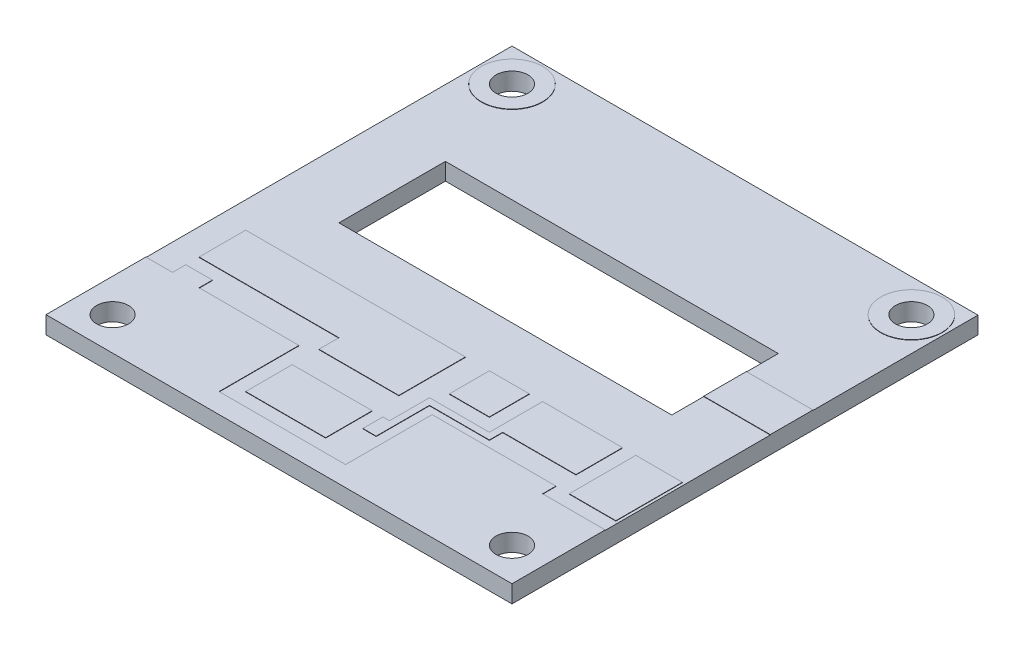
ISO-10303-21;
HEADER;
FILE_DESCRIPTION(('STEP AP214'),'2;1');
FILE_NAME('part.step','',(''),(''),'','','');
FILE_SCHEMA(('AUTOMOTIVE_DESIGN { 1 0 10303 214 1 1 1 1 }'));
ENDSEC;
DATA;
#1=APPLICATION_CONTEXT('core data for automotive mechanical design processes');
#2=APPLICATION_PROTOCOL_DEFINITION('international standard','automotive_design',2000,#1);
#3=PRODUCT_CONTEXT('',#1,'mechanical');
#4=PRODUCT('Part','Part','',(#3));
#5=PRODUCT_RELATED_PRODUCT_CATEGORY('part','',(#4));
#6=PRODUCT_DEFINITION_FORMATION('','',#4);
#7=PRODUCT_DEFINITION_CONTEXT('part definition',#1,'design');
#8=PRODUCT_DEFINITION('design','',#6,#7);
#9=PRODUCT_DEFINITION_SHAPE('','',#8);
#10=(LENGTH_UNIT() NAMED_UNIT(*) SI_UNIT(.MILLI.,.METRE.));
#11=(NAMED_UNIT(*) PLANE_ANGLE_UNIT() SI_UNIT($,.RADIAN.));
#12=(NAMED_UNIT(*) SI_UNIT($,.STERADIAN.) SOLID_ANGLE_UNIT());
#13=UNCERTAINTY_MEASURE_WITH_UNIT(LENGTH_MEASURE(1.E-05),#10,'distance_accuracy_value','');
#14=(GEOMETRIC_REPRESENTATION_CONTEXT(3) GLOBAL_UNCERTAINTY_ASSIGNED_CONTEXT((#13)) GLOBAL_UNIT_ASSIGNED_CONTEXT((#10,
#11,#12)) REPRESENTATION_CONTEXT('',''));
#15=CARTESIAN_POINT('',(0.,0.,0.));
#16=DIRECTION('',(0.,0.,1.));
#17=DIRECTION('',(1.,0.,0.));
#18=AXIS2_PLACEMENT_3D('',#15,#16,#17);
#19=CARTESIAN_POINT('',(0.,1.6002,0.));
#20=DIRECTION('',(0.,-1.,0.));
#21=DIRECTION('',(0.,0.,-1.));
#22=AXIS2_PLACEMENT_3D('',#19,#20,#21);
#23=PLANE('',#22);
#24=CARTESIAN_POINT('',(19.05,1.6002,-19.05));
#25=DIRECTION('',(0.,-1.,0.));
#26=DIRECTION('',(0.,0.,-1.));
#27=AXIS2_PLACEMENT_3D('',#24,#25,#26);
#28=CIRCLE('',#27,2.921);
#29=CARTESIAN_POINT('',(19.05,1.6002,-21.971));
#30=VERTEX_POINT('',#29);
#31=EDGE_CURVE('E11',#30,#30,#28,.F.);
#32=ORIENTED_EDGE('',*,*,#31,.F.);
#33=EDGE_LOOP('',(#32));
#34=FACE_BOUND('',#33,.T.);
#35=CARTESIAN_POINT('',(-19.05,1.6002,-19.05));
#36=DIRECTION('',(0.,-1.,0.));
#37=DIRECTION('',(0.,0.,-1.));
#38=AXIS2_PLACEMENT_3D('',#35,#36,#37);
#39=CIRCLE('',#38,2.921);
#40=CARTESIAN_POINT('',(-19.05,1.6002,-21.971));
#41=VERTEX_POINT('',#40);
#42=EDGE_CURVE('E40',#41,#41,#39,.F.);
#43=ORIENTED_EDGE('',*,*,#42,.F.);
#44=EDGE_LOOP('',(#43));
#45=FACE_BOUND('',#44,.T.);
#46=DIRECTION('',(1.,0.,0.));
#47=VECTOR('',#46,1.);
#48=CARTESIAN_POINT('',(22.225,1.6002,-2.413));
#49=LINE('',#48,#47);
#50=CARTESIAN_POINT('',(15.875,1.6002,-2.413));
#51=VERTEX_POINT('',#50);
#52=CARTESIAN_POINT('',(22.225,1.6002,-2.413));
#53=VERTEX_POINT('',#52);
#54=EDGE_CURVE('E394',#51,#53,#49,.T.);
#55=ORIENTED_EDGE('',*,*,#54,.F.);
#56=DIRECTION('',(0.,0.,-1.));
#57=VECTOR('',#56,1.);
#58=CARTESIAN_POINT('',(15.875,1.6002,0.635000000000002));
#59=LINE('',#58,#57);
#60=CARTESIAN_POINT('',(15.875,1.6002,0.635000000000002));
#61=VERTEX_POINT('',#60);
#62=EDGE_CURVE('E755',#61,#51,#59,.T.);
#63=ORIENTED_EDGE('',*,*,#62,.F.);
#64=DIRECTION('',(1.,0.,0.));
#65=VECTOR('',#64,1.);
#66=CARTESIAN_POINT('',(-15.875,1.6002,0.635000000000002));
#67=LINE('',#66,#65);
#68=CARTESIAN_POINT('',(-15.875,1.6002,0.635000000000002));
#69=VERTEX_POINT('',#68);
#70=EDGE_CURVE('E751',#69,#61,#67,.T.);
#71=ORIENTED_EDGE('',*,*,#70,.F.);
#72=DIRECTION('',(0.,0.,1.));
#73=VECTOR('',#72,1.);
#74=CARTESIAN_POINT('',(-15.875,1.6002,-9.525));
#75=LINE('',#74,#73);
#76=CARTESIAN_POINT('',(-15.875,1.6002,-9.525));
#77=VERTEX_POINT('',#76);
#78=EDGE_CURVE('E735',#77,#69,#75,.T.);
#79=ORIENTED_EDGE('',*,*,#78,.F.);
#80=DIRECTION('',(-1.,0.,0.));
#81=VECTOR('',#80,1.);
#82=CARTESIAN_POINT('',(15.875,1.6002,-9.525));
#83=LINE('',#82,#81);
#84=CARTESIAN_POINT('',(15.875,1.6002,-9.525));
#85=VERTEX_POINT('',#84);
#86=EDGE_CURVE('E740',#85,#77,#83,.T.);
#87=ORIENTED_EDGE('',*,*,#86,.F.);
#88=CARTESIAN_POINT('',(15.875,1.6002,-6.477));
#89=VERTEX_POINT('',#88);
#90=EDGE_CURVE('E754',#89,#85,#59,.T.);
#91=ORIENTED_EDGE('',*,*,#90,.F.);
#92=DIRECTION('',(-1.,0.,0.));
#93=VECTOR('',#92,1.);
#94=CARTESIAN_POINT('',(15.875,1.6002,-6.477));
#95=LINE('',#94,#93);
#96=CARTESIAN_POINT('',(22.225,1.6002,-6.477));
#97=VERTEX_POINT('',#96);
#98=EDGE_CURVE('E396',#97,#89,#95,.T.);
#99=ORIENTED_EDGE('',*,*,#98,.F.);
#100=DIRECTION('',(0.,0.,-1.));
#101=VECTOR('',#100,1.);
#102=CARTESIAN_POINT('',(22.225,1.6002,22.225));
#103=LINE('',#102,#101);
#104=CARTESIAN_POINT('',(22.225,1.6002,-22.225));
#105=VERTEX_POINT('',#104);
#106=EDGE_CURVE('E781',#97,#105,#103,.T.);
#107=ORIENTED_EDGE('',*,*,#106,.T.);
#108=DIRECTION('',(-1.,0.,0.));
#109=VECTOR('',#108,1.);
#110=CARTESIAN_POINT('',(-22.225,1.6002,-22.225));
#111=LINE('',#110,#109);
#112=CARTESIAN_POINT('',(-22.225,1.6002,-22.225));
#113=VERTEX_POINT('',#112);
#114=EDGE_CURVE('E785',#105,#113,#111,.T.);
#115=ORIENTED_EDGE('',*,*,#114,.T.);
#116=DIRECTION('',(0.,0.,1.));
#117=VECTOR('',#116,1.);
#118=CARTESIAN_POINT('',(-22.225,1.6002,22.225));
#119=LINE('',#118,#117);
#120=CARTESIAN_POINT('',(-22.225,1.6002,12.7));
#121=VERTEX_POINT('',#120);
#122=EDGE_CURVE('E787',#113,#121,#119,.T.);
#123=ORIENTED_EDGE('',*,*,#122,.T.);
#124=DIRECTION('',(-1.,0.,0.));
#125=VECTOR('',#124,1.);
#126=CARTESIAN_POINT('',(-22.225,1.6002,12.7));
#127=LINE('',#126,#125);
#128=CARTESIAN_POINT('',(-19.685,1.6002,12.7));
#129=VERTEX_POINT('',#128);
#130=EDGE_CURVE('E543',#129,#121,#127,.T.);
#131=ORIENTED_EDGE('',*,*,#130,.F.);
#132=DIRECTION('',(0.,0.,1.));
#133=VECTOR('',#132,1.);
#134=CARTESIAN_POINT('',(-19.685,1.6002,12.7));
#135=LINE('',#134,#133);
#136=CARTESIAN_POINT('',(-19.685,1.6002,11.43));
#137=VERTEX_POINT('',#136);
#138=EDGE_CURVE('E598',#137,#129,#135,.T.);
#139=ORIENTED_EDGE('',*,*,#138,.F.);
#140=DIRECTION('',(-1.,0.,0.));
#141=VECTOR('',#140,1.);
#142=CARTESIAN_POINT('',(-19.685,1.6002,11.43));
#143=LINE('',#142,#141);
#144=CARTESIAN_POINT('',(-17.145,1.6002,11.43));
#145=VERTEX_POINT('',#144);
#146=EDGE_CURVE('E595',#145,#137,#143,.T.);
#147=ORIENTED_EDGE('',*,*,#146,.F.);
#148=DIRECTION('',(0.,0.,-1.));
#149=VECTOR('',#148,1.);
#150=CARTESIAN_POINT('',(-17.145,1.6002,11.43));
#151=LINE('',#150,#149);
#152=CARTESIAN_POINT('',(-17.145,1.6002,12.7));
#153=VERTEX_POINT('',#152);
#154=EDGE_CURVE('E592',#153,#145,#151,.T.);
#155=ORIENTED_EDGE('',*,*,#154,.F.);
#156=DIRECTION('',(-1.,0.,0.));
#157=VECTOR('',#156,1.);
#158=CARTESIAN_POINT('',(-17.145,1.6002,12.7));
#159=LINE('',#158,#157);
#160=CARTESIAN_POINT('',(-7.61999999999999,1.6002,12.7));
#161=VERTEX_POINT('',#160);
#162=EDGE_CURVE('E589',#161,#153,#159,.T.);
#163=ORIENTED_EDGE('',*,*,#162,.F.);
#164=DIRECTION('',(0.,0.,-1.));
#165=VECTOR('',#164,1.);
#166=CARTESIAN_POINT('',(-7.61999999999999,1.6002,12.7));
#167=LINE('',#166,#165);
#168=CARTESIAN_POINT('',(-7.61999999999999,1.6002,20.32));
#169=VERTEX_POINT('',#168);
#170=EDGE_CURVE('E586',#169,#161,#167,.T.);
#171=ORIENTED_EDGE('',*,*,#170,.F.);
#172=DIRECTION('',(-1.,0.,0.));
#173=VECTOR('',#172,1.);
#174=CARTESIAN_POINT('',(-7.61999999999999,1.6002,20.32));
#175=LINE('',#174,#173);
#176=CARTESIAN_POINT('',(4.44500000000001,1.6002,20.32));
#177=VERTEX_POINT('',#176);
#178=EDGE_CURVE('E583',#177,#169,#175,.T.);
#179=ORIENTED_EDGE('',*,*,#178,.F.);
#180=DIRECTION('',(0.,0.,1.));
#181=VECTOR('',#180,1.);
#182=CARTESIAN_POINT('',(4.44500000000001,1.6002,20.32));
#183=LINE('',#182,#181);
#184=CARTESIAN_POINT('',(4.44500000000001,1.6002,12.065));
#185=VERTEX_POINT('',#184);
#186=EDGE_CURVE('E580',#185,#177,#183,.T.);
#187=ORIENTED_EDGE('',*,*,#186,.F.);
#188=DIRECTION('',(-1.,0.,0.));
#189=VECTOR('',#188,1.);
#190=CARTESIAN_POINT('',(4.44500000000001,1.6002,12.065));
#191=LINE('',#190,#189);
#192=CARTESIAN_POINT('',(16.256,1.6002,12.065));
#193=VERTEX_POINT('',#192);
#194=EDGE_CURVE('E577',#193,#185,#191,.T.);
#195=ORIENTED_EDGE('',*,*,#194,.F.);
#196=DIRECTION('',(0.,0.,-1.));
#197=VECTOR('',#196,1.);
#198=CARTESIAN_POINT('',(16.256,1.6002,12.065));
#199=LINE('',#198,#197);
#200=CARTESIAN_POINT('',(16.256,1.6002,13.335));
#201=VERTEX_POINT('',#200);
#202=EDGE_CURVE('E574',#201,#193,#199,.T.);
#203=ORIENTED_EDGE('',*,*,#202,.F.);
#204=DIRECTION('',(-1.,0.,0.));
#205=VECTOR('',#204,1.);
#206=CARTESIAN_POINT('',(16.256,1.6002,13.335));
#207=LINE('',#206,#205);
#208=CARTESIAN_POINT('',(22.225,1.6002,13.335));
#209=VERTEX_POINT('',#208);
#210=EDGE_CURVE('E538',#209,#201,#207,.T.);
#211=ORIENTED_EDGE('',*,*,#210,.F.);
#212=EDGE_CURVE('E782',#209,#53,#103,.T.);
#213=ORIENTED_EDGE('',*,*,#212,.T.);
#214=EDGE_LOOP('',(#55,#63,#71,#79,#87,#91,#99,#107,#115,#123,#131,#139,#147,#155,#163,#171,
#179,#187,#195,#203,#211,#213));
#215=FACE_BOUND('',#214,.T.);
#216=DIRECTION('',(0.,0.,1.));
#217=VECTOR('',#216,1.);
#218=CARTESIAN_POINT('',(-6.34999999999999,1.6002,14.605));
#219=LINE('',#218,#217);
#220=CARTESIAN_POINT('',(-6.34999999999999,1.6002,14.605));
#221=VERTEX_POINT('',#220);
#222=CARTESIAN_POINT('',(-6.34999999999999,1.6002,19.05));
#223=VERTEX_POINT('',#222);
#224=EDGE_CURVE('E472',#221,#223,#219,.T.);
#225=ORIENTED_EDGE('',*,*,#224,.F.);
#226=DIRECTION('',(-1.,0.,0.));
#227=VECTOR('',#226,1.);
#228=CARTESIAN_POINT('',(1.27000000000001,1.6002,14.605));
#229=LINE('',#228,#227);
#230=CARTESIAN_POINT('',(1.27000000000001,1.6002,14.605));
#231=VERTEX_POINT('',#230);
#232=EDGE_CURVE('E477',#231,#221,#229,.T.);
#233=ORIENTED_EDGE('',*,*,#232,.F.);
#234=DIRECTION('',(0.,0.,-1.));
#235=VECTOR('',#234,1.);
#236=CARTESIAN_POINT('',(1.27000000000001,1.6002,19.05));
#237=LINE('',#236,#235);
#238=CARTESIAN_POINT('',(1.27000000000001,1.6002,19.05));
#239=VERTEX_POINT('',#238);
#240=EDGE_CURVE('E489',#239,#231,#237,.T.);
#241=ORIENTED_EDGE('',*,*,#240,.F.);
#242=DIRECTION('',(1.,0.,0.));
#243=VECTOR('',#242,1.);
#244=CARTESIAN_POINT('',(-6.34999999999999,1.6002,19.05));
#245=LINE('',#244,#243);
#246=EDGE_CURVE('E486',#223,#239,#245,.T.);
#247=ORIENTED_EDGE('',*,*,#246,.F.);
#248=EDGE_LOOP('',(#225,#233,#241,#247));
#249=FACE_BOUND('',#248,.T.);
#250=DIRECTION('',(-1.,0.,0.));
#251=VECTOR('',#250,1.);
#252=CARTESIAN_POINT('',(16.256,1.6002,5.715));
#253=LINE('',#252,#251);
#254=CARTESIAN_POINT('',(16.256,1.6002,5.715));
#255=VERTEX_POINT('',#254);
#256=CARTESIAN_POINT('',(8.63600000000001,1.6002,5.715));
#257=VERTEX_POINT('',#256);
#258=EDGE_CURVE('E638',#255,#257,#253,.T.);
#259=ORIENTED_EDGE('',*,*,#258,.F.);
#260=DIRECTION('',(0.,0.,-1.));
#261=VECTOR('',#260,1.);
#262=CARTESIAN_POINT('',(16.256,1.6002,10.16));
#263=LINE('',#262,#261);
#264=CARTESIAN_POINT('',(16.256,1.6002,10.16));
#265=VERTEX_POINT('',#264);
#266=EDGE_CURVE('E643',#265,#255,#263,.T.);
#267=ORIENTED_EDGE('',*,*,#266,.F.);
#268=DIRECTION('',(1.,0.,0.));
#269=VECTOR('',#268,1.);
#270=CARTESIAN_POINT('',(9.27100000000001,1.6002,10.16));
#271=LINE('',#270,#269);
#272=CARTESIAN_POINT('',(9.27100000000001,1.6002,10.16));
#273=VERTEX_POINT('',#272);
#274=EDGE_CURVE('E695',#273,#265,#271,.T.);
#275=ORIENTED_EDGE('',*,*,#274,.F.);
#276=DIRECTION('',(0.,0.,-1.));
#277=VECTOR('',#276,1.);
#278=CARTESIAN_POINT('',(9.27100000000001,1.6002,11.43));
#279=LINE('',#278,#277);
#280=CARTESIAN_POINT('',(9.27100000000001,1.6002,11.43));
#281=VERTEX_POINT('',#280);
#282=EDGE_CURVE('E692',#281,#273,#279,.T.);
#283=ORIENTED_EDGE('',*,*,#282,.F.);
#284=DIRECTION('',(1.,0.,0.));
#285=VECTOR('',#284,1.);
#286=CARTESIAN_POINT('',(3.55600000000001,1.6002,11.43));
#287=LINE('',#286,#285);
#288=CARTESIAN_POINT('',(3.55600000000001,1.6002,11.43));
#289=VERTEX_POINT('',#288);
#290=EDGE_CURVE('E689',#289,#281,#287,.T.);
#291=ORIENTED_EDGE('',*,*,#290,.F.);
#292=DIRECTION('',(0.,0.,-1.));
#293=VECTOR('',#292,1.);
#294=CARTESIAN_POINT('',(3.55600000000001,1.6002,12.065));
#295=LINE('',#294,#293);
#296=CARTESIAN_POINT('',(3.55600000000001,1.6002,16.51));
#297=VERTEX_POINT('',#296);
#298=EDGE_CURVE('E686',#297,#289,#295,.T.);
#299=ORIENTED_EDGE('',*,*,#298,.F.);
#300=DIRECTION('',(1.,0.,0.));
#301=VECTOR('',#300,1.);
#302=CARTESIAN_POINT('',(2.28600000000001,1.6002,16.51));
#303=LINE('',#302,#301);
#304=CARTESIAN_POINT('',(2.28600000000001,1.6002,16.51));
#305=VERTEX_POINT('',#304);
#306=EDGE_CURVE('E683',#305,#297,#303,.T.);
#307=ORIENTED_EDGE('',*,*,#306,.F.);
#308=DIRECTION('',(0.,0.,1.));
#309=VECTOR('',#308,1.);
#310=CARTESIAN_POINT('',(2.28600000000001,1.6002,14.605));
#311=LINE('',#310,#309);
#312=CARTESIAN_POINT('',(2.28600000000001,1.6002,14.605));
#313=VERTEX_POINT('',#312);
#314=EDGE_CURVE('E680',#313,#305,#311,.T.);
#315=ORIENTED_EDGE('',*,*,#314,.F.);
#316=DIRECTION('',(-1.,0.,0.));
#317=VECTOR('',#316,1.);
#318=CARTESIAN_POINT('',(2.92100000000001,1.6002,14.605));
#319=LINE('',#318,#317);
#320=CARTESIAN_POINT('',(2.92100000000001,1.6002,14.605));
#321=VERTEX_POINT('',#320);
#322=EDGE_CURVE('E677',#321,#313,#319,.T.);
#323=ORIENTED_EDGE('',*,*,#322,.F.);
#324=DIRECTION('',(0.,0.,1.));
#325=VECTOR('',#324,1.);
#326=CARTESIAN_POINT('',(2.92100000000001,1.6002,10.795));
#327=LINE('',#326,#325);
#328=CARTESIAN_POINT('',(2.92100000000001,1.6002,10.795));
#329=VERTEX_POINT('',#328);
#330=EDGE_CURVE('E674',#329,#321,#327,.T.);
#331=ORIENTED_EDGE('',*,*,#330,.F.);
#332=DIRECTION('',(-1.,0.,0.));
#333=VECTOR('',#332,1.);
#334=CARTESIAN_POINT('',(8.63600000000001,1.6002,10.795));
#335=LINE('',#334,#333);
#336=CARTESIAN_POINT('',(8.63600000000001,1.6002,10.795));
#337=VERTEX_POINT('',#336);
#338=EDGE_CURVE('E671',#337,#329,#335,.T.);
#339=ORIENTED_EDGE('',*,*,#338,.F.);
#340=DIRECTION('',(0.,0.,1.));
#341=VECTOR('',#340,1.);
#342=CARTESIAN_POINT('',(8.63600000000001,1.6002,10.16));
#343=LINE('',#342,#341);
#344=EDGE_CURVE('E668',#257,#337,#343,.T.);
#345=ORIENTED_EDGE('',*,*,#344,.F.);
#346=EDGE_LOOP('',(#259,#267,#275,#283,#291,#299,#307,#315,#323,#331,#339,#345));
#347=FACE_BOUND('',#346,.T.);
#348=DIRECTION('',(-1.,0.,0.));
#349=VECTOR('',#348,1.);
#350=CARTESIAN_POINT('',(3.55600000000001,1.6002,5.715));
#351=LINE('',#350,#349);
#352=CARTESIAN_POINT('',(7.36600000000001,1.6002,5.715));
#353=VERTEX_POINT('',#352);
#354=CARTESIAN_POINT('',(3.55600000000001,1.6002,5.715));
#355=VERTEX_POINT('',#354);
#356=EDGE_CURVE('E505',#353,#355,#351,.T.);
#357=ORIENTED_EDGE('',*,*,#356,.F.);
#358=DIRECTION('',(0.,0.,-1.));
#359=VECTOR('',#358,1.);
#360=CARTESIAN_POINT('',(7.36600000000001,1.6002,5.715));
#361=LINE('',#360,#359);
#362=CARTESIAN_POINT('',(7.366,1.6002,9.525));
#363=VERTEX_POINT('',#362);
#364=EDGE_CURVE('E510',#363,#353,#361,.T.);
#365=ORIENTED_EDGE('',*,*,#364,.F.);
#366=DIRECTION('',(1.,0.,0.));
#367=VECTOR('',#366,1.);
#368=CARTESIAN_POINT('',(7.366,1.6002,9.525));
#369=LINE('',#368,#367);
#370=CARTESIAN_POINT('',(3.55600000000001,1.6002,9.525));
#371=VERTEX_POINT('',#370);
#372=EDGE_CURVE('E522',#371,#363,#369,.T.);
#373=ORIENTED_EDGE('',*,*,#372,.F.);
#374=DIRECTION('',(0.,0.,1.));
#375=VECTOR('',#374,1.);
#376=CARTESIAN_POINT('',(3.55600000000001,1.6002,5.715));
#377=LINE('',#376,#375);
#378=EDGE_CURVE('E519',#355,#371,#377,.T.);
#379=ORIENTED_EDGE('',*,*,#378,.F.);
#380=EDGE_LOOP('',(#357,#365,#373,#379));
#381=FACE_BOUND('',#380,.T.);
#382=DIRECTION('',(1.,0.,0.));
#383=VECTOR('',#382,1.);
#384=CARTESIAN_POINT('',(-6.34999999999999,1.6002,10.16));
#385=LINE('',#384,#383);
#386=CARTESIAN_POINT('',(-19.685,1.6002,10.16));
#387=VERTEX_POINT('',#386);
#388=CARTESIAN_POINT('',(-6.34999999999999,1.6002,10.16));
#389=VERTEX_POINT('',#388);
#390=EDGE_CURVE('E423',#387,#389,#385,.T.);
#391=ORIENTED_EDGE('',*,*,#390,.F.);
#392=DIRECTION('',(0.,0.,1.));
#393=VECTOR('',#392,1.);
#394=CARTESIAN_POINT('',(-19.685,1.6002,10.16));
#395=LINE('',#394,#393);
#396=CARTESIAN_POINT('',(-19.685,1.6002,5.715));
#397=VERTEX_POINT('',#396);
#398=EDGE_CURVE('E428',#397,#387,#395,.T.);
#399=ORIENTED_EDGE('',*,*,#398,.F.);
#400=DIRECTION('',(-1.,0.,0.));
#401=VECTOR('',#400,1.);
#402=CARTESIAN_POINT('',(-19.685,1.6002,5.715));
#403=LINE('',#402,#401);
#404=CARTESIAN_POINT('',(1.27000000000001,1.6002,5.715));
#405=VERTEX_POINT('',#404);
#406=EDGE_CURVE('E450',#405,#397,#403,.T.);
#407=ORIENTED_EDGE('',*,*,#406,.F.);
#408=DIRECTION('',(0.,0.,-1.));
#409=VECTOR('',#408,1.);
#410=CARTESIAN_POINT('',(1.27000000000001,1.6002,12.065));
#411=LINE('',#410,#409);
#412=CARTESIAN_POINT('',(1.27000000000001,1.6002,12.065));
#413=VERTEX_POINT('',#412);
#414=EDGE_CURVE('E447',#413,#405,#411,.T.);
#415=ORIENTED_EDGE('',*,*,#414,.F.);
#416=DIRECTION('',(1.,0.,0.));
#417=VECTOR('',#416,1.);
#418=CARTESIAN_POINT('',(-6.34999999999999,1.6002,12.065));
#419=LINE('',#418,#417);
#420=CARTESIAN_POINT('',(-6.34999999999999,1.6002,12.065));
#421=VERTEX_POINT('',#420);
#422=EDGE_CURVE('E444',#421,#413,#419,.T.);
#423=ORIENTED_EDGE('',*,*,#422,.F.);
#424=DIRECTION('',(0.,0.,1.));
#425=VECTOR('',#424,1.);
#426=CARTESIAN_POINT('',(-6.34999999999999,1.6002,12.065));
#427=LINE('',#426,#425);
#428=EDGE_CURVE('E441',#389,#421,#427,.T.);
#429=ORIENTED_EDGE('',*,*,#428,.F.);
#430=EDGE_LOOP('',(#391,#399,#407,#415,#423,#429));
#431=FACE_BOUND('',#430,.T.);
#432=DIRECTION('',(0.,0.,1.));
#433=VECTOR('',#432,1.);
#434=CARTESIAN_POINT('',(17.526,1.6002,5.715));
#435=LINE('',#434,#433);
#436=CARTESIAN_POINT('',(17.526,1.6002,5.715));
#437=VERTEX_POINT('',#436);
#438=CARTESIAN_POINT('',(17.526,1.6002,12.065));
#439=VERTEX_POINT('',#438);
#440=EDGE_CURVE('E393',#437,#439,#435,.T.);
#441=ORIENTED_EDGE('',*,*,#440,.F.);
#442=DIRECTION('',(-1.,0.,0.));
#443=VECTOR('',#442,1.);
#444=CARTESIAN_POINT('',(21.971,1.6002,5.715));
#445=LINE('',#444,#443);
#446=CARTESIAN_POINT('',(21.971,1.6002,5.715));
#447=VERTEX_POINT('',#446);
#448=EDGE_CURVE('E390',#447,#437,#445,.T.);
#449=ORIENTED_EDGE('',*,*,#448,.F.);
#450=DIRECTION('',(0.,0.,-1.));
#451=VECTOR('',#450,1.);
#452=CARTESIAN_POINT('',(21.971,1.6002,12.065));
#453=LINE('',#452,#451);
#454=CARTESIAN_POINT('',(21.971,1.6002,12.065));
#455=VERTEX_POINT('',#454);
#456=EDGE_CURVE('E52',#455,#447,#453,.T.);
#457=ORIENTED_EDGE('',*,*,#456,.F.);
#458=DIRECTION('',(1.,0.,0.));
#459=VECTOR('',#458,1.);
#460=CARTESIAN_POINT('',(17.526,1.6002,12.065));
#461=LINE('',#460,#459);
#462=EDGE_CURVE('E47',#439,#455,#461,.T.);
#463=ORIENTED_EDGE('',*,*,#462,.F.);
#464=EDGE_LOOP('',(#441,#449,#457,#463));
#465=FACE_BOUND('',#464,.T.);
#466=ADVANCED_FACE('F32',(#34,#45,#215,#249,#347,#381,#431,#465),#23,.F.);
#467=CARTESIAN_POINT('',(22.225,1.6002,22.225));
#468=DIRECTION('',(-1.,0.,0.));
#469=DIRECTION('',(0.,0.,1.));
#470=AXIS2_PLACEMENT_3D('',#467,#468,#469);
#471=PLANE('',#470);
#472=DIRECTION('',(0.,-1.,0.));
#473=VECTOR('',#472,1.);
#474=CARTESIAN_POINT('',(22.225,1.6002,22.225));
#475=LINE('',#474,#473);
#476=CARTESIAN_POINT('',(22.225,1.63576,22.225));
#477=VERTEX_POINT('',#476);
#478=CARTESIAN_POINT('',(22.225,-0.03556,22.225));
#479=VERTEX_POINT('',#478);
#480=EDGE_CURVE('E789',#477,#479,#475,.T.);
#481=ORIENTED_EDGE('',*,*,#480,.T.);
#482=DIRECTION('',(0.,0.,1.));
#483=VECTOR('',#482,1.);
#484=CARTESIAN_POINT('',(22.225,-0.03556,-22.225));
#485=LINE('',#484,#483);
#486=CARTESIAN_POINT('',(22.225,-0.03556,-22.225));
#487=VERTEX_POINT('',#486);
#488=EDGE_CURVE('E762',#487,#479,#485,.T.);
#489=ORIENTED_EDGE('',*,*,#488,.F.);
#490=DIRECTION('',(0.,-1.,0.));
#491=VECTOR('',#490,1.);
#492=CARTESIAN_POINT('',(22.225,1.6002,-22.225));
#493=LINE('',#492,#491);
#494=EDGE_CURVE('E795',#105,#487,#493,.T.);
#495=ORIENTED_EDGE('',*,*,#494,.F.);
#496=ORIENTED_EDGE('',*,*,#106,.F.);
#497=DIRECTION('',(0.,-1.,0.));
#498=VECTOR('',#497,1.);
#499=CARTESIAN_POINT('',(22.225,1.63576,-6.477));
#500=LINE('',#499,#498);
#501=CARTESIAN_POINT('',(22.225,1.63576,-6.477));
#502=VERTEX_POINT('',#501);
#503=EDGE_CURVE('E416',#502,#97,#500,.T.);
#504=ORIENTED_EDGE('',*,*,#503,.F.);
#505=DIRECTION('',(0.,0.,-1.));
#506=VECTOR('',#505,1.);
#507=CARTESIAN_POINT('',(22.225,1.63576,-6.477));
#508=LINE('',#507,#506);
#509=CARTESIAN_POINT('',(22.225,1.63576,-2.413));
#510=VERTEX_POINT('',#509);
#511=EDGE_CURVE('E407',#510,#502,#508,.T.);
#512=ORIENTED_EDGE('',*,*,#511,.F.);
#513=DIRECTION('',(0.,-1.,0.));
#514=VECTOR('',#513,1.);
#515=CARTESIAN_POINT('',(22.225,1.63576,-2.413));
#516=LINE('',#515,#514);
#517=EDGE_CURVE('E418',#510,#53,#516,.T.);
#518=ORIENTED_EDGE('',*,*,#517,.T.);
#519=ORIENTED_EDGE('',*,*,#212,.F.);
#520=DIRECTION('',(0.,-1.,0.));
#521=VECTOR('',#520,1.);
#522=CARTESIAN_POINT('',(22.225,1.63576,13.335));
#523=LINE('',#522,#521);
#524=CARTESIAN_POINT('',(22.225,1.63576,13.335));
#525=VERTEX_POINT('',#524);
#526=EDGE_CURVE('E571',#525,#209,#523,.T.);
#527=ORIENTED_EDGE('',*,*,#526,.F.);
#528=DIRECTION('',(0.,0.,-1.));
#529=VECTOR('',#528,1.);
#530=CARTESIAN_POINT('',(22.225,1.63576,13.335));
#531=LINE('',#530,#529);
#532=EDGE_CURVE('E569',#477,#525,#531,.T.);
#533=ORIENTED_EDGE('',*,*,#532,.F.);
#534=EDGE_LOOP('',(#481,#489,#495,#496,#504,#512,#518,#519,#527,#533));
#535=FACE_BOUND('',#534,.T.);
#536=ADVANCED_FACE('F34',(#535),#471,.F.);
#537=CARTESIAN_POINT('',(-22.225,1.6002,-22.225));
#538=DIRECTION('',(0.,0.,1.));
#539=DIRECTION('',(1.,0.,0.));
#540=AXIS2_PLACEMENT_3D('',#537,#538,#539);
#541=PLANE('',#540);
#542=ORIENTED_EDGE('',*,*,#494,.T.);
#543=DIRECTION('',(1.,0.,0.));
#544=VECTOR('',#543,1.);
#545=CARTESIAN_POINT('',(-22.225,-0.03556,-22.225));
#546=LINE('',#545,#544);
#547=CARTESIAN_POINT('',(-22.225,-0.03556,-22.225));
#548=VERTEX_POINT('',#547);
#549=EDGE_CURVE('E778',#548,#487,#546,.T.);
#550=ORIENTED_EDGE('',*,*,#549,.F.);
#551=DIRECTION('',(0.,-1.,0.));
#552=VECTOR('',#551,1.);
#553=CARTESIAN_POINT('',(-22.225,1.6002,-22.225));
#554=LINE('',#553,#552);
#555=EDGE_CURVE('E793',#113,#548,#554,.T.);
#556=ORIENTED_EDGE('',*,*,#555,.F.);
#557=ORIENTED_EDGE('',*,*,#114,.F.);
#558=EDGE_LOOP('',(#542,#550,#556,#557));
#559=FACE_BOUND('',#558,.T.);
#560=ADVANCED_FACE('F938',(#559),#541,.F.);
#561=CARTESIAN_POINT('',(-22.225,1.6002,22.225));
#562=DIRECTION('',(1.,0.,0.));
#563=DIRECTION('',(0.,0.,-1.));
#564=AXIS2_PLACEMENT_3D('',#561,#562,#563);
#565=PLANE('',#564);
#566=ORIENTED_EDGE('',*,*,#555,.T.);
#567=DIRECTION('',(0.,0.,-1.));
#568=VECTOR('',#567,1.);
#569=CARTESIAN_POINT('',(-22.225,-0.03556,-22.225));
#570=LINE('',#569,#568);
#571=CARTESIAN_POINT('',(-22.225,-0.03556,22.225));
#572=VERTEX_POINT('',#571);
#573=EDGE_CURVE('E775',#572,#548,#570,.T.);
#574=ORIENTED_EDGE('',*,*,#573,.F.);
#575=DIRECTION('',(0.,-1.,0.));
#576=VECTOR('',#575,1.);
#577=CARTESIAN_POINT('',(-22.225,1.6002,22.225));
#578=LINE('',#577,#576);
#579=CARTESIAN_POINT('',(-22.225,1.63576,22.225));
#580=VERTEX_POINT('',#579);
#581=EDGE_CURVE('E791',#580,#572,#578,.T.);
#582=ORIENTED_EDGE('',*,*,#581,.F.);
#583=DIRECTION('',(0.,0.,1.));
#584=VECTOR('',#583,1.);
#585=CARTESIAN_POINT('',(-22.225,1.63576,22.225));
#586=LINE('',#585,#584);
#587=CARTESIAN_POINT('',(-22.225,1.63576,12.7));
#588=VERTEX_POINT('',#587);
#589=EDGE_CURVE('E563',#588,#580,#586,.T.);
#590=ORIENTED_EDGE('',*,*,#589,.F.);
#591=DIRECTION('',(0.,-1.,0.));
#592=VECTOR('',#591,1.);
#593=CARTESIAN_POINT('',(-22.225,1.63576,12.7));
#594=LINE('',#593,#592);
#595=EDGE_CURVE('E605',#588,#121,#594,.T.);
#596=ORIENTED_EDGE('',*,*,#595,.T.);
#597=ORIENTED_EDGE('',*,*,#122,.F.);
#598=EDGE_LOOP('',(#566,#574,#582,#590,#596,#597));
#599=FACE_BOUND('',#598,.T.);
#600=ADVANCED_FACE('F921',(#599),#565,.F.);
#601=CARTESIAN_POINT('',(-22.225,1.6002,22.225));
#602=DIRECTION('',(0.,0.,-1.));
#603=DIRECTION('',(-1.,0.,0.));
#604=AXIS2_PLACEMENT_3D('',#601,#602,#603);
#605=PLANE('',#604);
#606=ORIENTED_EDGE('',*,*,#581,.T.);
#607=DIRECTION('',(-1.,0.,0.));
#608=VECTOR('',#607,1.);
#609=CARTESIAN_POINT('',(-22.225,-0.03556,22.225));
#610=LINE('',#609,#608);
#611=EDGE_CURVE('E772',#479,#572,#610,.T.);
#612=ORIENTED_EDGE('',*,*,#611,.F.);
#613=ORIENTED_EDGE('',*,*,#480,.F.);
#614=DIRECTION('',(1.,0.,0.));
#615=VECTOR('',#614,1.);
#616=CARTESIAN_POINT('',(22.225,1.63576,22.225));
#617=LINE('',#616,#615);
#618=EDGE_CURVE('E566',#580,#477,#617,.T.);
#619=ORIENTED_EDGE('',*,*,#618,.F.);
#620=EDGE_LOOP('',(#606,#612,#613,#619));
#621=FACE_BOUND('',#620,.T.);
#622=ADVANCED_FACE('F925',(#621),#605,.F.);
#623=CARTESIAN_POINT('',(0.,-0.03556,0.));
#624=DIRECTION('',(0.,1.,0.));
#625=DIRECTION('',(0.,0.,1.));
#626=AXIS2_PLACEMENT_3D('',#623,#624,#625);
#627=PLANE('',#626);
#628=CARTESIAN_POINT('',(19.05,-0.03556,-19.05));
#629=DIRECTION('',(0.,1.,0.));
#630=DIRECTION('',(0.,0.,1.));
#631=AXIS2_PLACEMENT_3D('',#628,#629,#630);
#632=CIRCLE('',#631,1.524);
#633=CARTESIAN_POINT('',(19.05,-0.03556,-17.526));
#634=VERTEX_POINT('',#633);
#635=EDGE_CURVE('E835',#634,#634,#632,.T.);
#636=ORIENTED_EDGE('',*,*,#635,.T.);
#637=EDGE_LOOP('',(#636));
#638=FACE_BOUND('',#637,.T.);
#639=CARTESIAN_POINT('',(-19.05,-0.03556,19.05));
#640=DIRECTION('',(0.,1.,0.));
#641=DIRECTION('',(0.,0.,1.));
#642=AXIS2_PLACEMENT_3D('',#639,#640,#641);
#643=CIRCLE('',#642,1.524);
#644=CARTESIAN_POINT('',(-19.05,-0.03556,20.574));
#645=VERTEX_POINT('',#644);
#646=EDGE_CURVE('E841',#645,#645,#643,.T.);
#647=ORIENTED_EDGE('',*,*,#646,.T.);
#648=EDGE_LOOP('',(#647));
#649=FACE_BOUND('',#648,.T.);
#650=CARTESIAN_POINT('',(19.05,-0.03556,19.05));
#651=DIRECTION('',(0.,1.,0.));
#652=DIRECTION('',(0.,0.,1.));
#653=AXIS2_PLACEMENT_3D('',#650,#651,#652);
#654=CIRCLE('',#653,1.524);
#655=CARTESIAN_POINT('',(19.05,-0.03556,20.574));
#656=VERTEX_POINT('',#655);
#657=EDGE_CURVE('E842',#656,#656,#654,.T.);
#658=ORIENTED_EDGE('',*,*,#657,.T.);
#659=EDGE_LOOP('',(#658));
#660=FACE_BOUND('',#659,.T.);
#661=CARTESIAN_POINT('',(-19.05,-0.03556,-19.05));
#662=DIRECTION('',(0.,1.,0.));
#663=DIRECTION('',(0.,0.,1.));
#664=AXIS2_PLACEMENT_3D('',#661,#662,#663);
#665=CIRCLE('',#664,1.524);
#666=CARTESIAN_POINT('',(-19.05,-0.03556,-17.526));
#667=VERTEX_POINT('',#666);
#668=EDGE_CURVE('E831',#667,#667,#665,.T.);
#669=ORIENTED_EDGE('',*,*,#668,.T.);
#670=EDGE_LOOP('',(#669));
#671=FACE_BOUND('',#670,.T.);
#672=DIRECTION('',(-1.,0.,0.));
#673=VECTOR('',#672,1.);
#674=CARTESIAN_POINT('',(15.875,-0.03556,-9.525));
#675=LINE('',#674,#673);
#676=CARTESIAN_POINT('',(15.875,-0.03556,-9.525));
#677=VERTEX_POINT('',#676);
#678=CARTESIAN_POINT('',(-15.875,-0.03556,-9.525));
#679=VERTEX_POINT('',#678);
#680=EDGE_CURVE('E746',#677,#679,#675,.T.);
#681=ORIENTED_EDGE('',*,*,#680,.T.);
#682=DIRECTION('',(0.,0.,1.));
#683=VECTOR('',#682,1.);
#684=CARTESIAN_POINT('',(-15.875,-0.03556,-9.525));
#685=LINE('',#684,#683);
#686=CARTESIAN_POINT('',(-15.875,-0.03556,0.635000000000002));
#687=VERTEX_POINT('',#686);
#688=EDGE_CURVE('E736',#679,#687,#685,.T.);
#689=ORIENTED_EDGE('',*,*,#688,.T.);
#690=DIRECTION('',(1.,0.,0.));
#691=VECTOR('',#690,1.);
#692=CARTESIAN_POINT('',(-15.875,-0.03556,0.635000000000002));
#693=LINE('',#692,#691);
#694=CARTESIAN_POINT('',(15.875,-0.03556,0.635000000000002));
#695=VERTEX_POINT('',#694);
#696=EDGE_CURVE('E739',#687,#695,#693,.T.);
#697=ORIENTED_EDGE('',*,*,#696,.T.);
#698=DIRECTION('',(0.,0.,-1.));
#699=VECTOR('',#698,1.);
#700=CARTESIAN_POINT('',(15.875,-0.03556,0.635000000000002));
#701=LINE('',#700,#699);
#702=EDGE_CURVE('E743',#695,#677,#701,.T.);
#703=ORIENTED_EDGE('',*,*,#702,.T.);
#704=EDGE_LOOP('',(#681,#689,#697,#703));
#705=FACE_BOUND('',#704,.T.);
#706=ORIENTED_EDGE('',*,*,#488,.T.);
#707=ORIENTED_EDGE('',*,*,#611,.T.);
#708=ORIENTED_EDGE('',*,*,#573,.T.);
#709=ORIENTED_EDGE('',*,*,#549,.T.);
#710=EDGE_LOOP('',(#706,#707,#708,#709));
#711=FACE_BOUND('',#710,.T.);
#712=ADVANCED_FACE('F856',(#638,#649,#660,#671,#705,#711),#627,.F.);
#713=CARTESIAN_POINT('',(-15.875,-0.03556,-9.525));
#714=DIRECTION('',(-1.,0.,0.));
#715=DIRECTION('',(0.,0.,1.));
#716=AXIS2_PLACEMENT_3D('',#713,#714,#715);
#717=PLANE('',#716);
#718=ORIENTED_EDGE('',*,*,#78,.T.);
#719=DIRECTION('',(0.,1.,0.));
#720=VECTOR('',#719,1.);
#721=CARTESIAN_POINT('',(-15.875,-0.03556,0.635000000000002));
#722=LINE('',#721,#720);
#723=EDGE_CURVE('E749',#687,#69,#722,.T.);
#724=ORIENTED_EDGE('',*,*,#723,.F.);
#725=ORIENTED_EDGE('',*,*,#688,.F.);
#726=DIRECTION('',(0.,1.,0.));
#727=VECTOR('',#726,1.);
#728=CARTESIAN_POINT('',(-15.875,-0.03556,-9.525));
#729=LINE('',#728,#727);
#730=EDGE_CURVE('E760',#679,#77,#729,.T.);
#731=ORIENTED_EDGE('',*,*,#730,.T.);
#732=EDGE_LOOP('',(#718,#724,#725,#731));
#733=FACE_BOUND('',#732,.T.);
#734=ADVANCED_FACE('F963',(#733),#717,.F.);
#735=CARTESIAN_POINT('',(15.875,-0.03556,-9.525));
#736=DIRECTION('',(0.,0.,-1.));
#737=DIRECTION('',(-1.,0.,0.));
#738=AXIS2_PLACEMENT_3D('',#735,#736,#737);
#739=PLANE('',#738);
#740=ORIENTED_EDGE('',*,*,#86,.T.);
#741=ORIENTED_EDGE('',*,*,#730,.F.);
#742=ORIENTED_EDGE('',*,*,#680,.F.);
#743=DIRECTION('',(0.,1.,0.));
#744=VECTOR('',#743,1.);
#745=CARTESIAN_POINT('',(15.875,-0.03556,-9.525));
#746=LINE('',#745,#744);
#747=EDGE_CURVE('E763',#677,#85,#746,.T.);
#748=ORIENTED_EDGE('',*,*,#747,.T.);
#749=EDGE_LOOP('',(#740,#741,#742,#748));
#750=FACE_BOUND('',#749,.T.);
#751=ADVANCED_FACE('F966',(#750),#739,.F.);
#752=CARTESIAN_POINT('',(15.875,-0.03556,0.635000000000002));
#753=DIRECTION('',(1.,0.,0.));
#754=DIRECTION('',(0.,0.,-1.));
#755=AXIS2_PLACEMENT_3D('',#752,#753,#754);
#756=PLANE('',#755);
#757=ORIENTED_EDGE('',*,*,#62,.T.);
#758=DIRECTION('',(0.,-1.,0.));
#759=VECTOR('',#758,1.);
#760=CARTESIAN_POINT('',(15.875,1.63576,-2.413));
#761=LINE('',#760,#759);
#762=CARTESIAN_POINT('',(15.875,1.63576,-2.413));
#763=VERTEX_POINT('',#762);
#764=EDGE_CURVE('E421',#763,#51,#761,.T.);
#765=ORIENTED_EDGE('',*,*,#764,.F.);
#766=DIRECTION('',(0.,0.,1.));
#767=VECTOR('',#766,1.);
#768=CARTESIAN_POINT('',(15.875,1.63576,-2.413));
#769=LINE('',#768,#767);
#770=CARTESIAN_POINT('',(15.875,1.63576,-6.477));
#771=VERTEX_POINT('',#770);
#772=EDGE_CURVE('E402',#771,#763,#769,.T.);
#773=ORIENTED_EDGE('',*,*,#772,.F.);
#774=DIRECTION('',(0.,-1.,0.));
#775=VECTOR('',#774,1.);
#776=CARTESIAN_POINT('',(15.875,1.63576,-6.477));
#777=LINE('',#776,#775);
#778=EDGE_CURVE('E411',#771,#89,#777,.T.);
#779=ORIENTED_EDGE('',*,*,#778,.T.);
#780=ORIENTED_EDGE('',*,*,#90,.T.);
#781=ORIENTED_EDGE('',*,*,#747,.F.);
#782=ORIENTED_EDGE('',*,*,#702,.F.);
#783=DIRECTION('',(0.,1.,0.));
#784=VECTOR('',#783,1.);
#785=CARTESIAN_POINT('',(15.875,-0.03556,0.635000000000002));
#786=LINE('',#785,#784);
#787=EDGE_CURVE('E766',#695,#61,#786,.T.);
#788=ORIENTED_EDGE('',*,*,#787,.T.);
#789=EDGE_LOOP('',(#757,#765,#773,#779,#780,#781,#782,#788));
#790=FACE_BOUND('',#789,.T.);
#791=ADVANCED_FACE('F954',(#790),#756,.F.);
#792=CARTESIAN_POINT('',(-15.875,-0.03556,0.635000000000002));
#793=DIRECTION('',(0.,0.,1.));
#794=DIRECTION('',(1.,0.,0.));
#795=AXIS2_PLACEMENT_3D('',#792,#793,#794);
#796=PLANE('',#795);
#797=ORIENTED_EDGE('',*,*,#70,.T.);
#798=ORIENTED_EDGE('',*,*,#787,.F.);
#799=ORIENTED_EDGE('',*,*,#696,.F.);
#800=ORIENTED_EDGE('',*,*,#723,.T.);
#801=EDGE_LOOP('',(#797,#798,#799,#800));
#802=FACE_BOUND('',#801,.T.);
#803=ADVANCED_FACE('F959',(#802),#796,.F.);
#804=CARTESIAN_POINT('',(16.256,1.63576,5.715));
#805=DIRECTION('',(0.,0.,1.));
#806=DIRECTION('',(1.,0.,0.));
#807=AXIS2_PLACEMENT_3D('',#804,#805,#806);
#808=PLANE('',#807);
#809=ORIENTED_EDGE('',*,*,#258,.T.);
#810=DIRECTION('',(0.,-1.,0.));
#811=VECTOR('',#810,1.);
#812=CARTESIAN_POINT('',(8.63600000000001,1.63576,5.715));
#813=LINE('',#812,#811);
#814=CARTESIAN_POINT('',(8.63600000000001,1.63576,5.715));
#815=VERTEX_POINT('',#814);
#816=EDGE_CURVE('E732',#815,#257,#813,.T.);
#817=ORIENTED_EDGE('',*,*,#816,.F.);
#818=DIRECTION('',(-1.,0.,0.));
#819=VECTOR('',#818,1.);
#820=CARTESIAN_POINT('',(16.256,1.63576,5.715));
#821=LINE('',#820,#819);
#822=CARTESIAN_POINT('',(16.256,1.63576,5.715));
#823=VERTEX_POINT('',#822);
#824=EDGE_CURVE('E639',#823,#815,#821,.T.);
#825=ORIENTED_EDGE('',*,*,#824,.F.);
#826=DIRECTION('',(0.,-1.,0.));
#827=VECTOR('',#826,1.);
#828=CARTESIAN_POINT('',(16.256,1.63576,5.715));
#829=LINE('',#828,#827);
#830=EDGE_CURVE('E665',#823,#255,#829,.T.);
#831=ORIENTED_EDGE('',*,*,#830,.T.);
#832=EDGE_LOOP('',(#809,#817,#825,#831));
#833=FACE_BOUND('',#832,.T.);
#834=ADVANCED_FACE('F1247',(#833),#808,.F.);
#835=CARTESIAN_POINT('',(8.63600000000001,1.63576,10.16));
#836=DIRECTION('',(1.,0.,0.));
#837=DIRECTION('',(0.,0.,-1.));
#838=AXIS2_PLACEMENT_3D('',#835,#836,#837);
#839=PLANE('',#838);
#840=ORIENTED_EDGE('',*,*,#344,.T.);
#841=DIRECTION('',(0.,-1.,0.));
#842=VECTOR('',#841,1.);
#843=CARTESIAN_POINT('',(8.63600000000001,1.63576,10.795));
#844=LINE('',#843,#842);
#845=CARTESIAN_POINT('',(8.63600000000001,1.63576,10.795));
#846=VERTEX_POINT('',#845);
#847=EDGE_CURVE('E729',#846,#337,#844,.T.);
#848=ORIENTED_EDGE('',*,*,#847,.F.);
#849=DIRECTION('',(0.,0.,1.));
#850=VECTOR('',#849,1.);
#851=CARTESIAN_POINT('',(8.63600000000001,1.63576,5.715));
#852=LINE('',#851,#850);
#853=EDGE_CURVE('E642',#815,#846,#852,.T.);
#854=ORIENTED_EDGE('',*,*,#853,.F.);
#855=ORIENTED_EDGE('',*,*,#816,.T.);
#856=EDGE_LOOP('',(#840,#848,#854,#855));
#857=FACE_BOUND('',#856,.T.);
#858=ADVANCED_FACE('F1243',(#857),#839,.F.);
#859=CARTESIAN_POINT('',(8.63600000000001,1.63576,10.795));
#860=DIRECTION('',(0.,0.,1.));
#861=DIRECTION('',(1.,0.,0.));
#862=AXIS2_PLACEMENT_3D('',#859,#860,#861);
#863=PLANE('',#862);
#864=ORIENTED_EDGE('',*,*,#338,.T.);
#865=DIRECTION('',(0.,-1.,0.));
#866=VECTOR('',#865,1.);
#867=CARTESIAN_POINT('',(2.92100000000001,1.63576,10.795));
#868=LINE('',#867,#866);
#869=CARTESIAN_POINT('',(2.92100000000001,1.63576,10.795));
#870=VERTEX_POINT('',#869);
#871=EDGE_CURVE('E726',#870,#329,#868,.T.);
#872=ORIENTED_EDGE('',*,*,#871,.F.);
#873=DIRECTION('',(-1.,0.,0.));
#874=VECTOR('',#873,1.);
#875=CARTESIAN_POINT('',(8.63600000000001,1.63576,10.795));
#876=LINE('',#875,#874);
#877=EDGE_CURVE('E645',#846,#870,#876,.T.);
#878=ORIENTED_EDGE('',*,*,#877,.F.);
#879=ORIENTED_EDGE('',*,*,#847,.T.);
#880=EDGE_LOOP('',(#864,#872,#878,#879));
#881=FACE_BOUND('',#880,.T.);
#882=ADVANCED_FACE('F1239',(#881),#863,.F.);
#883=CARTESIAN_POINT('',(2.92100000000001,1.63576,10.795));
#884=DIRECTION('',(1.,0.,0.));
#885=DIRECTION('',(0.,0.,-1.));
#886=AXIS2_PLACEMENT_3D('',#883,#884,#885);
#887=PLANE('',#886);
#888=ORIENTED_EDGE('',*,*,#330,.T.);
#889=DIRECTION('',(0.,-1.,0.));
#890=VECTOR('',#889,1.);
#891=CARTESIAN_POINT('',(2.92100000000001,1.63576,14.605));
#892=LINE('',#891,#890);
#893=CARTESIAN_POINT('',(2.92100000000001,1.63576,14.605));
#894=VERTEX_POINT('',#893);
#895=EDGE_CURVE('E723',#894,#321,#892,.T.);
#896=ORIENTED_EDGE('',*,*,#895,.F.);
#897=DIRECTION('',(0.,0.,1.));
#898=VECTOR('',#897,1.);
#899=CARTESIAN_POINT('',(2.92100000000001,1.63576,10.795));
#900=LINE('',#899,#898);
#901=EDGE_CURVE('E647',#870,#894,#900,.T.);
#902=ORIENTED_EDGE('',*,*,#901,.F.);
#903=ORIENTED_EDGE('',*,*,#871,.T.);
#904=EDGE_LOOP('',(#888,#896,#902,#903));
#905=FACE_BOUND('',#904,.T.);
#906=ADVANCED_FACE('F1235',(#905),#887,.F.);
#907=CARTESIAN_POINT('',(2.92100000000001,1.63576,14.605));
#908=DIRECTION('',(0.,0.,1.));
#909=DIRECTION('',(1.,0.,0.));
#910=AXIS2_PLACEMENT_3D('',#907,#908,#909);
#911=PLANE('',#910);
#912=ORIENTED_EDGE('',*,*,#322,.T.);
#913=DIRECTION('',(0.,-1.,0.));
#914=VECTOR('',#913,1.);
#915=CARTESIAN_POINT('',(2.28600000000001,1.63576,14.605));
#916=LINE('',#915,#914);
#917=CARTESIAN_POINT('',(2.28600000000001,1.63576,14.605));
#918=VERTEX_POINT('',#917);
#919=EDGE_CURVE('E720',#918,#313,#916,.T.);
#920=ORIENTED_EDGE('',*,*,#919,.F.);
#921=DIRECTION('',(-1.,0.,0.));
#922=VECTOR('',#921,1.);
#923=CARTESIAN_POINT('',(2.92100000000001,1.63576,14.605));
#924=LINE('',#923,#922);
#925=EDGE_CURVE('E649',#894,#918,#924,.T.);
#926=ORIENTED_EDGE('',*,*,#925,.F.);
#927=ORIENTED_EDGE('',*,*,#895,.T.);
#928=EDGE_LOOP('',(#912,#920,#926,#927));
#929=FACE_BOUND('',#928,.T.);
#930=ADVANCED_FACE('F1231',(#929),#911,.F.);
#931=CARTESIAN_POINT('',(2.28600000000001,1.63576,14.605));
#932=DIRECTION('',(1.,0.,0.));
#933=DIRECTION('',(0.,0.,-1.));
#934=AXIS2_PLACEMENT_3D('',#931,#932,#933);
#935=PLANE('',#934);
#936=ORIENTED_EDGE('',*,*,#314,.T.);
#937=DIRECTION('',(0.,-1.,0.));
#938=VECTOR('',#937,1.);
#939=CARTESIAN_POINT('',(2.28600000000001,1.63576,16.51));
#940=LINE('',#939,#938);
#941=CARTESIAN_POINT('',(2.28600000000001,1.63576,16.51));
#942=VERTEX_POINT('',#941);
#943=EDGE_CURVE('E717',#942,#305,#940,.T.);
#944=ORIENTED_EDGE('',*,*,#943,.F.);
#945=DIRECTION('',(0.,0.,1.));
#946=VECTOR('',#945,1.);
#947=CARTESIAN_POINT('',(2.28600000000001,1.63576,14.605));
#948=LINE('',#947,#946);
#949=EDGE_CURVE('E651',#918,#942,#948,.T.);
#950=ORIENTED_EDGE('',*,*,#949,.F.);
#951=ORIENTED_EDGE('',*,*,#919,.T.);
#952=EDGE_LOOP('',(#936,#944,#950,#951));
#953=FACE_BOUND('',#952,.T.);
#954=ADVANCED_FACE('F1227',(#953),#935,.F.);
#955=CARTESIAN_POINT('',(2.28600000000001,1.63576,16.51));
#956=DIRECTION('',(0.,0.,-1.));
#957=DIRECTION('',(-1.,0.,0.));
#958=AXIS2_PLACEMENT_3D('',#955,#956,#957);
#959=PLANE('',#958);
#960=ORIENTED_EDGE('',*,*,#306,.T.);
#961=DIRECTION('',(0.,-1.,0.));
#962=VECTOR('',#961,1.);
#963=CARTESIAN_POINT('',(3.55600000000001,1.63576,16.51));
#964=LINE('',#963,#962);
#965=CARTESIAN_POINT('',(3.55600000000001,1.63576,16.51));
#966=VERTEX_POINT('',#965);
#967=EDGE_CURVE('E714',#966,#297,#964,.T.);
#968=ORIENTED_EDGE('',*,*,#967,.F.);
#969=DIRECTION('',(1.,0.,0.));
#970=VECTOR('',#969,1.);
#971=CARTESIAN_POINT('',(2.28600000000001,1.63576,16.51));
#972=LINE('',#971,#970);
#973=EDGE_CURVE('E653',#942,#966,#972,.T.);
#974=ORIENTED_EDGE('',*,*,#973,.F.);
#975=ORIENTED_EDGE('',*,*,#943,.T.);
#976=EDGE_LOOP('',(#960,#968,#974,#975));
#977=FACE_BOUND('',#976,.T.);
#978=ADVANCED_FACE('F1223',(#977),#959,.F.);
#979=CARTESIAN_POINT('',(3.55600000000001,1.63576,12.065));
#980=DIRECTION('',(-1.,0.,0.));
#981=DIRECTION('',(0.,0.,1.));
#982=AXIS2_PLACEMENT_3D('',#979,#980,#981);
#983=PLANE('',#982);
#984=ORIENTED_EDGE('',*,*,#298,.T.);
#985=DIRECTION('',(0.,-1.,0.));
#986=VECTOR('',#985,1.);
#987=CARTESIAN_POINT('',(3.55600000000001,1.63576,11.43));
#988=LINE('',#987,#986);
#989=CARTESIAN_POINT('',(3.55600000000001,1.63576,11.43));
#990=VERTEX_POINT('',#989);
#991=EDGE_CURVE('E711',#990,#289,#988,.T.);
#992=ORIENTED_EDGE('',*,*,#991,.F.);
#993=DIRECTION('',(0.,0.,-1.));
#994=VECTOR('',#993,1.);
#995=CARTESIAN_POINT('',(3.55600000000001,1.63576,16.51));
#996=LINE('',#995,#994);
#997=EDGE_CURVE('E655',#966,#990,#996,.T.);
#998=ORIENTED_EDGE('',*,*,#997,.F.);
#999=ORIENTED_EDGE('',*,*,#967,.T.);
#1000=EDGE_LOOP('',(#984,#992,#998,#999));
#1001=FACE_BOUND('',#1000,.T.);
#1002=ADVANCED_FACE('F1219',(#1001),#983,.F.);
#1003=CARTESIAN_POINT('',(3.55600000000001,1.63576,11.43));
#1004=DIRECTION('',(0.,0.,-1.));
#1005=DIRECTION('',(-1.,0.,0.));
#1006=AXIS2_PLACEMENT_3D('',#1003,#1004,#1005);
#1007=PLANE('',#1006);
#1008=ORIENTED_EDGE('',*,*,#290,.T.);
#1009=DIRECTION('',(0.,-1.,0.));
#1010=VECTOR('',#1009,1.);
#1011=CARTESIAN_POINT('',(9.27100000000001,1.63576,11.43));
#1012=LINE('',#1011,#1010);
#1013=CARTESIAN_POINT('',(9.27100000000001,1.63576,11.43));
#1014=VERTEX_POINT('',#1013);
#1015=EDGE_CURVE('E708',#1014,#281,#1012,.T.);
#1016=ORIENTED_EDGE('',*,*,#1015,.F.);
#1017=DIRECTION('',(1.,0.,0.));
#1018=VECTOR('',#1017,1.);
#1019=CARTESIAN_POINT('',(3.55600000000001,1.63576,11.43));
#1020=LINE('',#1019,#1018);
#1021=EDGE_CURVE('E657',#990,#1014,#1020,.T.);
#1022=ORIENTED_EDGE('',*,*,#1021,.F.);
#1023=ORIENTED_EDGE('',*,*,#991,.T.);
#1024=EDGE_LOOP('',(#1008,#1016,#1022,#1023));
#1025=FACE_BOUND('',#1024,.T.);
#1026=ADVANCED_FACE('F1215',(#1025),#1007,.F.);
#1027=CARTESIAN_POINT('',(9.27100000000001,1.63576,11.43));
#1028=DIRECTION('',(-1.,0.,0.));
#1029=DIRECTION('',(0.,0.,1.));
#1030=AXIS2_PLACEMENT_3D('',#1027,#1028,#1029);
#1031=PLANE('',#1030);
#1032=ORIENTED_EDGE('',*,*,#282,.T.);
#1033=DIRECTION('',(0.,-1.,0.));
#1034=VECTOR('',#1033,1.);
#1035=CARTESIAN_POINT('',(9.27100000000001,1.63576,10.16));
#1036=LINE('',#1035,#1034);
#1037=CARTESIAN_POINT('',(9.27100000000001,1.63576,10.16));
#1038=VERTEX_POINT('',#1037);
#1039=EDGE_CURVE('E705',#1038,#273,#1036,.T.);
#1040=ORIENTED_EDGE('',*,*,#1039,.F.);
#1041=DIRECTION('',(0.,0.,-1.));
#1042=VECTOR('',#1041,1.);
#1043=CARTESIAN_POINT('',(9.27100000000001,1.63576,11.43));
#1044=LINE('',#1043,#1042);
#1045=EDGE_CURVE('E659',#1014,#1038,#1044,.T.);
#1046=ORIENTED_EDGE('',*,*,#1045,.F.);
#1047=ORIENTED_EDGE('',*,*,#1015,.T.);
#1048=EDGE_LOOP('',(#1032,#1040,#1046,#1047));
#1049=FACE_BOUND('',#1048,.T.);
#1050=ADVANCED_FACE('F1211',(#1049),#1031,.F.);
#1051=CARTESIAN_POINT('',(9.27100000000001,1.63576,10.16));
#1052=DIRECTION('',(0.,0.,-1.));
#1053=DIRECTION('',(-1.,0.,0.));
#1054=AXIS2_PLACEMENT_3D('',#1051,#1052,#1053);
#1055=PLANE('',#1054);
#1056=ORIENTED_EDGE('',*,*,#274,.T.);
#1057=DIRECTION('',(0.,-1.,0.));
#1058=VECTOR('',#1057,1.);
#1059=CARTESIAN_POINT('',(16.256,1.63576,10.16));
#1060=LINE('',#1059,#1058);
#1061=CARTESIAN_POINT('',(16.256,1.63576,10.16));
#1062=VERTEX_POINT('',#1061);
#1063=EDGE_CURVE('E702',#1062,#265,#1060,.T.);
#1064=ORIENTED_EDGE('',*,*,#1063,.F.);
#1065=DIRECTION('',(1.,0.,0.));
#1066=VECTOR('',#1065,1.);
#1067=CARTESIAN_POINT('',(9.27100000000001,1.63576,10.16));
#1068=LINE('',#1067,#1066);
#1069=EDGE_CURVE('E661',#1038,#1062,#1068,.T.);
#1070=ORIENTED_EDGE('',*,*,#1069,.F.);
#1071=ORIENTED_EDGE('',*,*,#1039,.T.);
#1072=EDGE_LOOP('',(#1056,#1064,#1070,#1071));
#1073=FACE_BOUND('',#1072,.T.);
#1074=ADVANCED_FACE('F1207',(#1073),#1055,.F.);
#1075=CARTESIAN_POINT('',(16.256,1.63576,10.16));
#1076=DIRECTION('',(-1.,0.,0.));
#1077=DIRECTION('',(0.,0.,1.));
#1078=AXIS2_PLACEMENT_3D('',#1075,#1076,#1077);
#1079=PLANE('',#1078);
#1080=ORIENTED_EDGE('',*,*,#266,.T.);
#1081=ORIENTED_EDGE('',*,*,#830,.F.);
#1082=DIRECTION('',(0.,0.,-1.));
#1083=VECTOR('',#1082,1.);
#1084=CARTESIAN_POINT('',(16.256,1.63576,10.16));
#1085=LINE('',#1084,#1083);
#1086=EDGE_CURVE('E663',#1062,#823,#1085,.T.);
#1087=ORIENTED_EDGE('',*,*,#1086,.F.);
#1088=ORIENTED_EDGE('',*,*,#1063,.T.);
#1089=EDGE_LOOP('',(#1080,#1081,#1087,#1088));
#1090=FACE_BOUND('',#1089,.T.);
#1091=ADVANCED_FACE('F1203',(#1090),#1079,.F.);
#1092=CARTESIAN_POINT('',(0.,1.63576,0.));
#1093=DIRECTION('',(0.,1.,0.));
#1094=DIRECTION('',(0.,0.,1.));
#1095=AXIS2_PLACEMENT_3D('',#1092,#1093,#1094);
#1096=PLANE('',#1095);
#1097=ORIENTED_EDGE('',*,*,#824,.T.);
#1098=ORIENTED_EDGE('',*,*,#853,.T.);
#1099=ORIENTED_EDGE('',*,*,#877,.T.);
#1100=ORIENTED_EDGE('',*,*,#901,.T.);
#1101=ORIENTED_EDGE('',*,*,#925,.T.);
#1102=ORIENTED_EDGE('',*,*,#949,.T.);
#1103=ORIENTED_EDGE('',*,*,#973,.T.);
#1104=ORIENTED_EDGE('',*,*,#997,.T.);
#1105=ORIENTED_EDGE('',*,*,#1021,.T.);
#1106=ORIENTED_EDGE('',*,*,#1045,.T.);
#1107=ORIENTED_EDGE('',*,*,#1069,.T.);
#1108=ORIENTED_EDGE('',*,*,#1086,.T.);
#1109=EDGE_LOOP('',(#1097,#1098,#1099,#1100,#1101,#1102,#1103,#1104,#1105,#1106,#1107,#1108));
#1110=FACE_BOUND('',#1109,.T.);
#1111=ADVANCED_FACE('F1200',(#1110),#1096,.T.);
#1112=CARTESIAN_POINT('',(16.256,1.63576,13.335));
#1113=DIRECTION('',(0.,0.,1.));
#1114=DIRECTION('',(1.,0.,0.));
#1115=AXIS2_PLACEMENT_3D('',#1112,#1113,#1114);
#1116=PLANE('',#1115);
#1117=ORIENTED_EDGE('',*,*,#210,.T.);
#1118=DIRECTION('',(0.,-1.,0.));
#1119=VECTOR('',#1118,1.);
#1120=CARTESIAN_POINT('',(16.256,1.63576,13.335));
#1121=LINE('',#1120,#1119);
#1122=CARTESIAN_POINT('',(16.256,1.63576,13.335));
#1123=VERTEX_POINT('',#1122);
#1124=EDGE_CURVE('E635',#1123,#201,#1121,.T.);
#1125=ORIENTED_EDGE('',*,*,#1124,.F.);
#1126=DIRECTION('',(-1.,0.,0.));
#1127=VECTOR('',#1126,1.);
#1128=CARTESIAN_POINT('',(16.256,1.63576,13.335));
#1129=LINE('',#1128,#1127);
#1130=EDGE_CURVE('E539',#525,#1123,#1129,.T.);
#1131=ORIENTED_EDGE('',*,*,#1130,.F.);
#1132=ORIENTED_EDGE('',*,*,#526,.T.);
#1133=EDGE_LOOP('',(#1117,#1125,#1131,#1132));
#1134=FACE_BOUND('',#1133,.T.);
#1135=ADVANCED_FACE('F880',(#1134),#1116,.F.);
#1136=CARTESIAN_POINT('',(16.256,1.63576,12.065));
#1137=DIRECTION('',(-1.,0.,0.));
#1138=DIRECTION('',(0.,0.,1.));
#1139=AXIS2_PLACEMENT_3D('',#1136,#1137,#1138);
#1140=PLANE('',#1139);
#1141=ORIENTED_EDGE('',*,*,#202,.T.);
#1142=DIRECTION('',(0.,-1.,0.));
#1143=VECTOR('',#1142,1.);
#1144=CARTESIAN_POINT('',(16.256,1.63576,12.065));
#1145=LINE('',#1144,#1143);
#1146=CARTESIAN_POINT('',(16.256,1.63576,12.065));
#1147=VERTEX_POINT('',#1146);
#1148=EDGE_CURVE('E632',#1147,#193,#1145,.T.);
#1149=ORIENTED_EDGE('',*,*,#1148,.F.);
#1150=DIRECTION('',(0.,0.,-1.));
#1151=VECTOR('',#1150,1.);
#1152=CARTESIAN_POINT('',(16.256,1.63576,12.065));
#1153=LINE('',#1152,#1151);
#1154=EDGE_CURVE('E542',#1123,#1147,#1153,.T.);
#1155=ORIENTED_EDGE('',*,*,#1154,.F.);
#1156=ORIENTED_EDGE('',*,*,#1124,.T.);
#1157=EDGE_LOOP('',(#1141,#1149,#1155,#1156));
#1158=FACE_BOUND('',#1157,.T.);
#1159=ADVANCED_FACE('F882',(#1158),#1140,.F.);
#1160=CARTESIAN_POINT('',(4.44500000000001,1.63576,12.065));
#1161=DIRECTION('',(0.,0.,1.));
#1162=DIRECTION('',(1.,0.,0.));
#1163=AXIS2_PLACEMENT_3D('',#1160,#1161,#1162);
#1164=PLANE('',#1163);
#1165=ORIENTED_EDGE('',*,*,#194,.T.);
#1166=DIRECTION('',(0.,-1.,0.));
#1167=VECTOR('',#1166,1.);
#1168=CARTESIAN_POINT('',(4.44500000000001,1.63576,12.065));
#1169=LINE('',#1168,#1167);
#1170=CARTESIAN_POINT('',(4.44500000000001,1.63576,12.065));
#1171=VERTEX_POINT('',#1170);
#1172=EDGE_CURVE('E629',#1171,#185,#1169,.T.);
#1173=ORIENTED_EDGE('',*,*,#1172,.F.);
#1174=DIRECTION('',(-1.,0.,0.));
#1175=VECTOR('',#1174,1.);
#1176=CARTESIAN_POINT('',(4.44500000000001,1.63576,12.065));
#1177=LINE('',#1176,#1175);
#1178=EDGE_CURVE('E545',#1147,#1171,#1177,.T.);
#1179=ORIENTED_EDGE('',*,*,#1178,.F.);
#1180=ORIENTED_EDGE('',*,*,#1148,.T.);
#1181=EDGE_LOOP('',(#1165,#1173,#1179,#1180));
#1182=FACE_BOUND('',#1181,.T.);
#1183=ADVANCED_FACE('F886',(#1182),#1164,.F.);
#1184=CARTESIAN_POINT('',(4.44500000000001,1.63576,20.32));
#1185=DIRECTION('',(1.,0.,0.));
#1186=DIRECTION('',(0.,0.,-1.));
#1187=AXIS2_PLACEMENT_3D('',#1184,#1185,#1186);
#1188=PLANE('',#1187);
#1189=ORIENTED_EDGE('',*,*,#186,.T.);
#1190=DIRECTION('',(0.,-1.,0.));
#1191=VECTOR('',#1190,1.);
#1192=CARTESIAN_POINT('',(4.44500000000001,1.63576,20.32));
#1193=LINE('',#1192,#1191);
#1194=CARTESIAN_POINT('',(4.44500000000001,1.63576,20.32));
#1195=VERTEX_POINT('',#1194);
#1196=EDGE_CURVE('E626',#1195,#177,#1193,.T.);
#1197=ORIENTED_EDGE('',*,*,#1196,.F.);
#1198=DIRECTION('',(0.,0.,1.));
#1199=VECTOR('',#1198,1.);
#1200=CARTESIAN_POINT('',(4.44500000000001,1.63576,20.32));
#1201=LINE('',#1200,#1199);
#1202=EDGE_CURVE('E547',#1171,#1195,#1201,.T.);
#1203=ORIENTED_EDGE('',*,*,#1202,.F.);
#1204=ORIENTED_EDGE('',*,*,#1172,.T.);
#1205=EDGE_LOOP('',(#1189,#1197,#1203,#1204));
#1206=FACE_BOUND('',#1205,.T.);
#1207=ADVANCED_FACE('F892',(#1206),#1188,.F.);
#1208=CARTESIAN_POINT('',(-7.61999999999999,1.63576,20.32));
#1209=DIRECTION('',(0.,0.,1.));
#1210=DIRECTION('',(1.,0.,0.));
#1211=AXIS2_PLACEMENT_3D('',#1208,#1209,#1210);
#1212=PLANE('',#1211);
#1213=ORIENTED_EDGE('',*,*,#178,.T.);
#1214=DIRECTION('',(0.,-1.,0.));
#1215=VECTOR('',#1214,1.);
#1216=CARTESIAN_POINT('',(-7.61999999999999,1.63576,20.32));
#1217=LINE('',#1216,#1215);
#1218=CARTESIAN_POINT('',(-7.61999999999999,1.63576,20.32));
#1219=VERTEX_POINT('',#1218);
#1220=EDGE_CURVE('E623',#1219,#169,#1217,.T.);
#1221=ORIENTED_EDGE('',*,*,#1220,.F.);
#1222=DIRECTION('',(-1.,0.,0.));
#1223=VECTOR('',#1222,1.);
#1224=CARTESIAN_POINT('',(-7.61999999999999,1.63576,20.32));
#1225=LINE('',#1224,#1223);
#1226=EDGE_CURVE('E549',#1195,#1219,#1225,.T.);
#1227=ORIENTED_EDGE('',*,*,#1226,.F.);
#1228=ORIENTED_EDGE('',*,*,#1196,.T.);
#1229=EDGE_LOOP('',(#1213,#1221,#1227,#1228));
#1230=FACE_BOUND('',#1229,.T.);
#1231=ADVANCED_FACE('F894',(#1230),#1212,.F.);
#1232=CARTESIAN_POINT('',(-7.61999999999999,1.63576,12.7));
#1233=DIRECTION('',(-1.,0.,0.));
#1234=DIRECTION('',(0.,0.,1.));
#1235=AXIS2_PLACEMENT_3D('',#1232,#1233,#1234);
#1236=PLANE('',#1235);
#1237=ORIENTED_EDGE('',*,*,#170,.T.);
#1238=DIRECTION('',(0.,-1.,0.));
#1239=VECTOR('',#1238,1.);
#1240=CARTESIAN_POINT('',(-7.61999999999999,1.63576,12.7));
#1241=LINE('',#1240,#1239);
#1242=CARTESIAN_POINT('',(-7.61999999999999,1.63576,12.7));
#1243=VERTEX_POINT('',#1242);
#1244=EDGE_CURVE('E620',#1243,#161,#1241,.T.);
#1245=ORIENTED_EDGE('',*,*,#1244,.F.);
#1246=DIRECTION('',(0.,0.,-1.));
#1247=VECTOR('',#1246,1.);
#1248=CARTESIAN_POINT('',(-7.61999999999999,1.63576,12.7));
#1249=LINE('',#1248,#1247);
#1250=EDGE_CURVE('E551',#1219,#1243,#1249,.T.);
#1251=ORIENTED_EDGE('',*,*,#1250,.F.);
#1252=ORIENTED_EDGE('',*,*,#1220,.T.);
#1253=EDGE_LOOP('',(#1237,#1245,#1251,#1252));
#1254=FACE_BOUND('',#1253,.T.);
#1255=ADVANCED_FACE('F898',(#1254),#1236,.F.);
#1256=CARTESIAN_POINT('',(-17.145,1.63576,12.7));
#1257=DIRECTION('',(0.,0.,1.));
#1258=DIRECTION('',(1.,0.,0.));
#1259=AXIS2_PLACEMENT_3D('',#1256,#1257,#1258);
#1260=PLANE('',#1259);
#1261=ORIENTED_EDGE('',*,*,#162,.T.);
#1262=DIRECTION('',(0.,-1.,0.));
#1263=VECTOR('',#1262,1.);
#1264=CARTESIAN_POINT('',(-17.145,1.63576,12.7));
#1265=LINE('',#1264,#1263);
#1266=CARTESIAN_POINT('',(-17.145,1.63576,12.7));
#1267=VERTEX_POINT('',#1266);
#1268=EDGE_CURVE('E617',#1267,#153,#1265,.T.);
#1269=ORIENTED_EDGE('',*,*,#1268,.F.);
#1270=DIRECTION('',(-1.,0.,0.));
#1271=VECTOR('',#1270,1.);
#1272=CARTESIAN_POINT('',(-17.145,1.63576,12.7));
#1273=LINE('',#1272,#1271);
#1274=EDGE_CURVE('E553',#1243,#1267,#1273,.T.);
#1275=ORIENTED_EDGE('',*,*,#1274,.F.);
#1276=ORIENTED_EDGE('',*,*,#1244,.T.);
#1277=EDGE_LOOP('',(#1261,#1269,#1275,#1276));
#1278=FACE_BOUND('',#1277,.T.);
#1279=ADVANCED_FACE('F904',(#1278),#1260,.F.);
#1280=CARTESIAN_POINT('',(-17.145,1.63576,11.43));
#1281=DIRECTION('',(-1.,0.,0.));
#1282=DIRECTION('',(0.,0.,1.));
#1283=AXIS2_PLACEMENT_3D('',#1280,#1281,#1282);
#1284=PLANE('',#1283);
#1285=ORIENTED_EDGE('',*,*,#154,.T.);
#1286=DIRECTION('',(0.,-1.,0.));
#1287=VECTOR('',#1286,1.);
#1288=CARTESIAN_POINT('',(-17.145,1.63576,11.43));
#1289=LINE('',#1288,#1287);
#1290=CARTESIAN_POINT('',(-17.145,1.63576,11.43));
#1291=VERTEX_POINT('',#1290);
#1292=EDGE_CURVE('E614',#1291,#145,#1289,.T.);
#1293=ORIENTED_EDGE('',*,*,#1292,.F.);
#1294=DIRECTION('',(0.,0.,-1.));
#1295=VECTOR('',#1294,1.);
#1296=CARTESIAN_POINT('',(-17.145,1.63576,11.43));
#1297=LINE('',#1296,#1295);
#1298=EDGE_CURVE('E555',#1267,#1291,#1297,.T.);
#1299=ORIENTED_EDGE('',*,*,#1298,.F.);
#1300=ORIENTED_EDGE('',*,*,#1268,.T.);
#1301=EDGE_LOOP('',(#1285,#1293,#1299,#1300));
#1302=FACE_BOUND('',#1301,.T.);
#1303=ADVANCED_FACE('F906',(#1302),#1284,.F.);
#1304=CARTESIAN_POINT('',(-19.685,1.63576,11.43));
#1305=DIRECTION('',(0.,0.,1.));
#1306=DIRECTION('',(1.,0.,0.));
#1307=AXIS2_PLACEMENT_3D('',#1304,#1305,#1306);
#1308=PLANE('',#1307);
#1309=ORIENTED_EDGE('',*,*,#146,.T.);
#1310=DIRECTION('',(0.,-1.,0.));
#1311=VECTOR('',#1310,1.);
#1312=CARTESIAN_POINT('',(-19.685,1.63576,11.43));
#1313=LINE('',#1312,#1311);
#1314=CARTESIAN_POINT('',(-19.685,1.63576,11.43));
#1315=VERTEX_POINT('',#1314);
#1316=EDGE_CURVE('E611',#1315,#137,#1313,.T.);
#1317=ORIENTED_EDGE('',*,*,#1316,.F.);
#1318=DIRECTION('',(-1.,0.,0.));
#1319=VECTOR('',#1318,1.);
#1320=CARTESIAN_POINT('',(-19.685,1.63576,11.43));
#1321=LINE('',#1320,#1319);
#1322=EDGE_CURVE('E557',#1291,#1315,#1321,.T.);
#1323=ORIENTED_EDGE('',*,*,#1322,.F.);
#1324=ORIENTED_EDGE('',*,*,#1292,.T.);
#1325=EDGE_LOOP('',(#1309,#1317,#1323,#1324));
#1326=FACE_BOUND('',#1325,.T.);
#1327=ADVANCED_FACE('F910',(#1326),#1308,.F.);
#1328=CARTESIAN_POINT('',(-19.685,1.63576,12.7));
#1329=DIRECTION('',(1.,0.,0.));
#1330=DIRECTION('',(0.,0.,-1.));
#1331=AXIS2_PLACEMENT_3D('',#1328,#1329,#1330);
#1332=PLANE('',#1331);
#1333=ORIENTED_EDGE('',*,*,#138,.T.);
#1334=DIRECTION('',(0.,-1.,0.));
#1335=VECTOR('',#1334,1.);
#1336=CARTESIAN_POINT('',(-19.685,1.63576,12.7));
#1337=LINE('',#1336,#1335);
#1338=CARTESIAN_POINT('',(-19.685,1.63576,12.7));
#1339=VERTEX_POINT('',#1338);
#1340=EDGE_CURVE('E608',#1339,#129,#1337,.T.);
#1341=ORIENTED_EDGE('',*,*,#1340,.F.);
#1342=DIRECTION('',(0.,0.,1.));
#1343=VECTOR('',#1342,1.);
#1344=CARTESIAN_POINT('',(-19.685,1.63576,12.7));
#1345=LINE('',#1344,#1343);
#1346=EDGE_CURVE('E559',#1315,#1339,#1345,.T.);
#1347=ORIENTED_EDGE('',*,*,#1346,.F.);
#1348=ORIENTED_EDGE('',*,*,#1316,.T.);
#1349=EDGE_LOOP('',(#1333,#1341,#1347,#1348));
#1350=FACE_BOUND('',#1349,.T.);
#1351=ADVANCED_FACE('F916',(#1350),#1332,.F.);
#1352=CARTESIAN_POINT('',(-22.225,1.63576,12.7));
#1353=DIRECTION('',(0.,0.,1.));
#1354=DIRECTION('',(1.,0.,0.));
#1355=AXIS2_PLACEMENT_3D('',#1352,#1353,#1354);
#1356=PLANE('',#1355);
#1357=ORIENTED_EDGE('',*,*,#130,.T.);
#1358=ORIENTED_EDGE('',*,*,#595,.F.);
#1359=DIRECTION('',(-1.,0.,0.));
#1360=VECTOR('',#1359,1.);
#1361=CARTESIAN_POINT('',(-22.225,1.63576,12.7));
#1362=LINE('',#1361,#1360);
#1363=EDGE_CURVE('E561',#1339,#588,#1362,.T.);
#1364=ORIENTED_EDGE('',*,*,#1363,.F.);
#1365=ORIENTED_EDGE('',*,*,#1340,.T.);
#1366=EDGE_LOOP('',(#1357,#1358,#1364,#1365));
#1367=FACE_BOUND('',#1366,.T.);
#1368=ADVANCED_FACE('F871',(#1367),#1356,.F.);
#1369=CARTESIAN_POINT('',(0.,1.63576,0.));
#1370=DIRECTION('',(0.,-1.,0.));
#1371=DIRECTION('',(0.,0.,-1.));
#1372=AXIS2_PLACEMENT_3D('',#1369,#1370,#1371);
#1373=PLANE('',#1372);
#1374=CARTESIAN_POINT('',(-19.05,1.63576,19.05));
#1375=DIRECTION('',(0.,1.,0.));
#1376=DIRECTION('',(0.,0.,1.));
#1377=AXIS2_PLACEMENT_3D('',#1374,#1375,#1376);
#1378=CIRCLE('',#1377,1.524);
#1379=CARTESIAN_POINT('',(-19.05,1.63576,20.574));
#1380=VERTEX_POINT('',#1379);
#1381=EDGE_CURVE('E838',#1380,#1380,#1378,.T.);
#1382=ORIENTED_EDGE('',*,*,#1381,.F.);
#1383=EDGE_LOOP('',(#1382));
#1384=FACE_BOUND('',#1383,.T.);
#1385=CARTESIAN_POINT('',(19.05,1.63576,19.05));
#1386=DIRECTION('',(0.,1.,0.));
#1387=DIRECTION('',(0.,0.,1.));
#1388=AXIS2_PLACEMENT_3D('',#1385,#1386,#1387);
#1389=CIRCLE('',#1388,1.524);
#1390=CARTESIAN_POINT('',(19.05,1.63576,20.574));
#1391=VERTEX_POINT('',#1390);
#1392=EDGE_CURVE('E850',#1391,#1391,#1389,.T.);
#1393=ORIENTED_EDGE('',*,*,#1392,.F.);
#1394=EDGE_LOOP('',(#1393));
#1395=FACE_BOUND('',#1394,.T.);
#1396=ORIENTED_EDGE('',*,*,#1130,.T.);
#1397=ORIENTED_EDGE('',*,*,#1154,.T.);
#1398=ORIENTED_EDGE('',*,*,#1178,.T.);
#1399=ORIENTED_EDGE('',*,*,#1202,.T.);
#1400=ORIENTED_EDGE('',*,*,#1226,.T.);
#1401=ORIENTED_EDGE('',*,*,#1250,.T.);
#1402=ORIENTED_EDGE('',*,*,#1274,.T.);
#1403=ORIENTED_EDGE('',*,*,#1298,.T.);
#1404=ORIENTED_EDGE('',*,*,#1322,.T.);
#1405=ORIENTED_EDGE('',*,*,#1346,.T.);
#1406=ORIENTED_EDGE('',*,*,#1363,.T.);
#1407=ORIENTED_EDGE('',*,*,#589,.T.);
#1408=ORIENTED_EDGE('',*,*,#618,.T.);
#1409=ORIENTED_EDGE('',*,*,#532,.T.);
#1410=EDGE_LOOP('',(#1396,#1397,#1398,#1399,#1400,#1401,#1402,#1403,#1404,#1405,#1406,#1407,
#1408,#1409));
#1411=FACE_BOUND('',#1410,.T.);
#1412=ADVANCED_FACE('F867',(#1384,#1395,#1411),#1373,.F.);
#1413=CARTESIAN_POINT('',(3.55600000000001,1.63576,5.715));
#1414=DIRECTION('',(0.,0.,1.));
#1415=DIRECTION('',(1.,0.,0.));
#1416=AXIS2_PLACEMENT_3D('',#1413,#1414,#1415);
#1417=PLANE('',#1416);
#1418=ORIENTED_EDGE('',*,*,#356,.T.);
#1419=DIRECTION('',(0.,-1.,0.));
#1420=VECTOR('',#1419,1.);
#1421=CARTESIAN_POINT('',(3.55600000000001,1.63576,5.715));
#1422=LINE('',#1421,#1420);
#1423=CARTESIAN_POINT('',(3.55600000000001,1.63576,5.715));
#1424=VERTEX_POINT('',#1423);
#1425=EDGE_CURVE('E535',#1424,#355,#1422,.T.);
#1426=ORIENTED_EDGE('',*,*,#1425,.F.);
#1427=DIRECTION('',(-1.,0.,0.));
#1428=VECTOR('',#1427,1.);
#1429=CARTESIAN_POINT('',(3.55600000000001,1.63576,5.715));
#1430=LINE('',#1429,#1428);
#1431=CARTESIAN_POINT('',(7.36600000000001,1.63576,5.715));
#1432=VERTEX_POINT('',#1431);
#1433=EDGE_CURVE('E506',#1432,#1424,#1430,.T.);
#1434=ORIENTED_EDGE('',*,*,#1433,.F.);
#1435=DIRECTION('',(0.,-1.,0.));
#1436=VECTOR('',#1435,1.);
#1437=CARTESIAN_POINT('',(7.36600000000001,1.63576,5.715));
#1438=LINE('',#1437,#1436);
#1439=EDGE_CURVE('E516',#1432,#353,#1438,.T.);
#1440=ORIENTED_EDGE('',*,*,#1439,.T.);
#1441=EDGE_LOOP('',(#1418,#1426,#1434,#1440));
#1442=FACE_BOUND('',#1441,.T.);
#1443=ADVANCED_FACE('F870',(#1442),#1417,.F.);
#1444=CARTESIAN_POINT('',(3.55600000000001,1.63576,5.715));
#1445=DIRECTION('',(1.,0.,0.));
#1446=DIRECTION('',(0.,0.,-1.));
#1447=AXIS2_PLACEMENT_3D('',#1444,#1445,#1446);
#1448=PLANE('',#1447);
#1449=ORIENTED_EDGE('',*,*,#378,.T.);
#1450=DIRECTION('',(0.,-1.,0.));
#1451=VECTOR('',#1450,1.);
#1452=CARTESIAN_POINT('',(3.55600000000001,1.63576,9.525));
#1453=LINE('',#1452,#1451);
#1454=CARTESIAN_POINT('',(3.55600000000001,1.63576,9.525));
#1455=VERTEX_POINT('',#1454);
#1456=EDGE_CURVE('E532',#1455,#371,#1453,.T.);
#1457=ORIENTED_EDGE('',*,*,#1456,.F.);
#1458=DIRECTION('',(0.,0.,1.));
#1459=VECTOR('',#1458,1.);
#1460=CARTESIAN_POINT('',(3.55600000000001,1.63576,5.715));
#1461=LINE('',#1460,#1459);
#1462=EDGE_CURVE('E509',#1424,#1455,#1461,.T.);
#1463=ORIENTED_EDGE('',*,*,#1462,.F.);
#1464=ORIENTED_EDGE('',*,*,#1425,.T.);
#1465=EDGE_LOOP('',(#1449,#1457,#1463,#1464));
#1466=FACE_BOUND('',#1465,.T.);
#1467=ADVANCED_FACE('F1172',(#1466),#1448,.F.);
#1468=CARTESIAN_POINT('',(7.366,1.63576,9.525));
#1469=DIRECTION('',(0.,0.,-1.));
#1470=DIRECTION('',(-1.,0.,0.));
#1471=AXIS2_PLACEMENT_3D('',#1468,#1469,#1470);
#1472=PLANE('',#1471);
#1473=ORIENTED_EDGE('',*,*,#372,.T.);
#1474=DIRECTION('',(0.,-1.,0.));
#1475=VECTOR('',#1474,1.);
#1476=CARTESIAN_POINT('',(7.366,1.63576,9.525));
#1477=LINE('',#1476,#1475);
#1478=CARTESIAN_POINT('',(7.366,1.63576,9.525));
#1479=VERTEX_POINT('',#1478);
#1480=EDGE_CURVE('E529',#1479,#363,#1477,.T.);
#1481=ORIENTED_EDGE('',*,*,#1480,.F.);
#1482=DIRECTION('',(1.,0.,0.));
#1483=VECTOR('',#1482,1.);
#1484=CARTESIAN_POINT('',(7.366,1.63576,9.525));
#1485=LINE('',#1484,#1483);
#1486=EDGE_CURVE('E512',#1455,#1479,#1485,.T.);
#1487=ORIENTED_EDGE('',*,*,#1486,.F.);
#1488=ORIENTED_EDGE('',*,*,#1456,.T.);
#1489=EDGE_LOOP('',(#1473,#1481,#1487,#1488));
#1490=FACE_BOUND('',#1489,.T.);
#1491=ADVANCED_FACE('F1168',(#1490),#1472,.F.);
#1492=CARTESIAN_POINT('',(7.36600000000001,1.63576,5.715));
#1493=DIRECTION('',(-1.,0.,0.));
#1494=DIRECTION('',(0.,0.,1.));
#1495=AXIS2_PLACEMENT_3D('',#1492,#1493,#1494);
#1496=PLANE('',#1495);
#1497=ORIENTED_EDGE('',*,*,#364,.T.);
#1498=ORIENTED_EDGE('',*,*,#1439,.F.);
#1499=DIRECTION('',(0.,0.,-1.));
#1500=VECTOR('',#1499,1.);
#1501=CARTESIAN_POINT('',(7.36600000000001,1.63576,5.715));
#1502=LINE('',#1501,#1500);
#1503=EDGE_CURVE('E514',#1479,#1432,#1502,.T.);
#1504=ORIENTED_EDGE('',*,*,#1503,.F.);
#1505=ORIENTED_EDGE('',*,*,#1480,.T.);
#1506=EDGE_LOOP('',(#1497,#1498,#1504,#1505));
#1507=FACE_BOUND('',#1506,.T.);
#1508=ADVANCED_FACE('F1164',(#1507),#1496,.F.);
#1509=CARTESIAN_POINT('',(0.,1.63576,0.));
#1510=DIRECTION('',(0.,-1.,0.));
#1511=DIRECTION('',(0.,0.,-1.));
#1512=AXIS2_PLACEMENT_3D('',#1509,#1510,#1511);
#1513=PLANE('',#1512);
#1514=ORIENTED_EDGE('',*,*,#1433,.T.);
#1515=ORIENTED_EDGE('',*,*,#1462,.T.);
#1516=ORIENTED_EDGE('',*,*,#1486,.T.);
#1517=ORIENTED_EDGE('',*,*,#1503,.T.);
#1518=EDGE_LOOP('',(#1514,#1515,#1516,#1517));
#1519=FACE_BOUND('',#1518,.T.);
#1520=ADVANCED_FACE('F1160',(#1519),#1513,.F.);
#1521=CARTESIAN_POINT('',(-6.34999999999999,1.63576,14.605));
#1522=DIRECTION('',(1.,0.,0.));
#1523=DIRECTION('',(0.,0.,-1.));
#1524=AXIS2_PLACEMENT_3D('',#1521,#1522,#1523);
#1525=PLANE('',#1524);
#1526=ORIENTED_EDGE('',*,*,#224,.T.);
#1527=DIRECTION('',(0.,-1.,0.));
#1528=VECTOR('',#1527,1.);
#1529=CARTESIAN_POINT('',(-6.34999999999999,1.63576,19.05));
#1530=LINE('',#1529,#1528);
#1531=CARTESIAN_POINT('',(-6.34999999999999,1.63576,19.05));
#1532=VERTEX_POINT('',#1531);
#1533=EDGE_CURVE('E502',#1532,#223,#1530,.T.);
#1534=ORIENTED_EDGE('',*,*,#1533,.F.);
#1535=DIRECTION('',(0.,0.,1.));
#1536=VECTOR('',#1535,1.);
#1537=CARTESIAN_POINT('',(-6.34999999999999,1.63576,14.605));
#1538=LINE('',#1537,#1536);
#1539=CARTESIAN_POINT('',(-6.34999999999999,1.63576,14.605));
#1540=VERTEX_POINT('',#1539);
#1541=EDGE_CURVE('E473',#1540,#1532,#1538,.T.);
#1542=ORIENTED_EDGE('',*,*,#1541,.F.);
#1543=DIRECTION('',(0.,-1.,0.));
#1544=VECTOR('',#1543,1.);
#1545=CARTESIAN_POINT('',(-6.34999999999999,1.63576,14.605));
#1546=LINE('',#1545,#1544);
#1547=EDGE_CURVE('E483',#1540,#221,#1546,.T.);
#1548=ORIENTED_EDGE('',*,*,#1547,.T.);
#1549=EDGE_LOOP('',(#1526,#1534,#1542,#1548));
#1550=FACE_BOUND('',#1549,.T.);
#1551=ADVANCED_FACE('F1156',(#1550),#1525,.F.);
#1552=CARTESIAN_POINT('',(-6.34999999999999,1.63576,19.05));
#1553=DIRECTION('',(0.,0.,-1.));
#1554=DIRECTION('',(-1.,0.,0.));
#1555=AXIS2_PLACEMENT_3D('',#1552,#1553,#1554);
#1556=PLANE('',#1555);
#1557=ORIENTED_EDGE('',*,*,#246,.T.);
#1558=DIRECTION('',(0.,-1.,0.));
#1559=VECTOR('',#1558,1.);
#1560=CARTESIAN_POINT('',(1.27000000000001,1.63576,19.05));
#1561=LINE('',#1560,#1559);
#1562=CARTESIAN_POINT('',(1.27000000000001,1.63576,19.05));
#1563=VERTEX_POINT('',#1562);
#1564=EDGE_CURVE('E499',#1563,#239,#1561,.T.);
#1565=ORIENTED_EDGE('',*,*,#1564,.F.);
#1566=DIRECTION('',(1.,0.,0.));
#1567=VECTOR('',#1566,1.);
#1568=CARTESIAN_POINT('',(-6.34999999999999,1.63576,19.05));
#1569=LINE('',#1568,#1567);
#1570=EDGE_CURVE('E476',#1532,#1563,#1569,.T.);
#1571=ORIENTED_EDGE('',*,*,#1570,.F.);
#1572=ORIENTED_EDGE('',*,*,#1533,.T.);
#1573=EDGE_LOOP('',(#1557,#1565,#1571,#1572));
#1574=FACE_BOUND('',#1573,.T.);
#1575=ADVANCED_FACE('F1152',(#1574),#1556,.F.);
#1576=CARTESIAN_POINT('',(1.27000000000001,1.63576,19.05));
#1577=DIRECTION('',(-1.,0.,0.));
#1578=DIRECTION('',(0.,0.,1.));
#1579=AXIS2_PLACEMENT_3D('',#1576,#1577,#1578);
#1580=PLANE('',#1579);
#1581=ORIENTED_EDGE('',*,*,#240,.T.);
#1582=DIRECTION('',(0.,-1.,0.));
#1583=VECTOR('',#1582,1.);
#1584=CARTESIAN_POINT('',(1.27000000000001,1.63576,14.605));
#1585=LINE('',#1584,#1583);
#1586=CARTESIAN_POINT('',(1.27000000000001,1.63576,14.605));
#1587=VERTEX_POINT('',#1586);
#1588=EDGE_CURVE('E496',#1587,#231,#1585,.T.);
#1589=ORIENTED_EDGE('',*,*,#1588,.F.);
#1590=DIRECTION('',(0.,0.,-1.));
#1591=VECTOR('',#1590,1.);
#1592=CARTESIAN_POINT('',(1.27000000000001,1.63576,19.05));
#1593=LINE('',#1592,#1591);
#1594=EDGE_CURVE('E479',#1563,#1587,#1593,.T.);
#1595=ORIENTED_EDGE('',*,*,#1594,.F.);
#1596=ORIENTED_EDGE('',*,*,#1564,.T.);
#1597=EDGE_LOOP('',(#1581,#1589,#1595,#1596));
#1598=FACE_BOUND('',#1597,.T.);
#1599=ADVANCED_FACE('F1148',(#1598),#1580,.F.);
#1600=CARTESIAN_POINT('',(1.27000000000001,1.63576,14.605));
#1601=DIRECTION('',(0.,0.,1.));
#1602=DIRECTION('',(1.,0.,0.));
#1603=AXIS2_PLACEMENT_3D('',#1600,#1601,#1602);
#1604=PLANE('',#1603);
#1605=ORIENTED_EDGE('',*,*,#232,.T.);
#1606=ORIENTED_EDGE('',*,*,#1547,.F.);
#1607=DIRECTION('',(-1.,0.,0.));
#1608=VECTOR('',#1607,1.);
#1609=CARTESIAN_POINT('',(1.27000000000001,1.63576,14.605));
#1610=LINE('',#1609,#1608);
#1611=EDGE_CURVE('E481',#1587,#1540,#1610,.T.);
#1612=ORIENTED_EDGE('',*,*,#1611,.F.);
#1613=ORIENTED_EDGE('',*,*,#1588,.T.);
#1614=EDGE_LOOP('',(#1605,#1606,#1612,#1613));
#1615=FACE_BOUND('',#1614,.T.);
#1616=ADVANCED_FACE('F1144',(#1615),#1604,.F.);
#1617=CARTESIAN_POINT('',(0.,1.63576,0.));
#1618=DIRECTION('',(0.,1.,0.));
#1619=DIRECTION('',(0.,0.,1.));
#1620=AXIS2_PLACEMENT_3D('',#1617,#1618,#1619);
#1621=PLANE('',#1620);
#1622=ORIENTED_EDGE('',*,*,#1541,.T.);
#1623=ORIENTED_EDGE('',*,*,#1570,.T.);
#1624=ORIENTED_EDGE('',*,*,#1594,.T.);
#1625=ORIENTED_EDGE('',*,*,#1611,.T.);
#1626=EDGE_LOOP('',(#1622,#1623,#1624,#1625));
#1627=FACE_BOUND('',#1626,.T.);
#1628=ADVANCED_FACE('F1140',(#1627),#1621,.T.);
#1629=CARTESIAN_POINT('',(-6.34999999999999,1.63576,10.16));
#1630=DIRECTION('',(0.,0.,-1.));
#1631=DIRECTION('',(-1.,0.,0.));
#1632=AXIS2_PLACEMENT_3D('',#1629,#1630,#1631);
#1633=PLANE('',#1632);
#1634=ORIENTED_EDGE('',*,*,#390,.T.);
#1635=DIRECTION('',(0.,-1.,0.));
#1636=VECTOR('',#1635,1.);
#1637=CARTESIAN_POINT('',(-6.34999999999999,1.63576,10.16));
#1638=LINE('',#1637,#1636);
#1639=CARTESIAN_POINT('',(-6.34999999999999,1.63576,10.16));
#1640=VERTEX_POINT('',#1639);
#1641=EDGE_CURVE('E469',#1640,#389,#1638,.T.);
#1642=ORIENTED_EDGE('',*,*,#1641,.F.);
#1643=DIRECTION('',(1.,0.,0.));
#1644=VECTOR('',#1643,1.);
#1645=CARTESIAN_POINT('',(-6.34999999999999,1.63576,10.16));
#1646=LINE('',#1645,#1644);
#1647=CARTESIAN_POINT('',(-19.685,1.63576,10.16));
#1648=VERTEX_POINT('',#1647);
#1649=EDGE_CURVE('E424',#1648,#1640,#1646,.T.);
#1650=ORIENTED_EDGE('',*,*,#1649,.F.);
#1651=DIRECTION('',(0.,-1.,0.));
#1652=VECTOR('',#1651,1.);
#1653=CARTESIAN_POINT('',(-19.685,1.63576,10.16));
#1654=LINE('',#1653,#1652);
#1655=EDGE_CURVE('E438',#1648,#387,#1654,.T.);
#1656=ORIENTED_EDGE('',*,*,#1655,.T.);
#1657=EDGE_LOOP('',(#1634,#1642,#1650,#1656));
#1658=FACE_BOUND('',#1657,.T.);
#1659=ADVANCED_FACE('F1136',(#1658),#1633,.F.);
#1660=CARTESIAN_POINT('',(-6.34999999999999,1.63576,12.065));
#1661=DIRECTION('',(1.,0.,0.));
#1662=DIRECTION('',(0.,0.,-1.));
#1663=AXIS2_PLACEMENT_3D('',#1660,#1661,#1662);
#1664=PLANE('',#1663);
#1665=ORIENTED_EDGE('',*,*,#428,.T.);
#1666=DIRECTION('',(0.,-1.,0.));
#1667=VECTOR('',#1666,1.);
#1668=CARTESIAN_POINT('',(-6.34999999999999,1.63576,12.065));
#1669=LINE('',#1668,#1667);
#1670=CARTESIAN_POINT('',(-6.34999999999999,1.63576,12.065));
#1671=VERTEX_POINT('',#1670);
#1672=EDGE_CURVE('E466',#1671,#421,#1669,.T.);
#1673=ORIENTED_EDGE('',*,*,#1672,.F.);
#1674=DIRECTION('',(0.,0.,1.));
#1675=VECTOR('',#1674,1.);
#1676=CARTESIAN_POINT('',(-6.34999999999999,1.63576,12.065));
#1677=LINE('',#1676,#1675);
#1678=EDGE_CURVE('E427',#1640,#1671,#1677,.T.);
#1679=ORIENTED_EDGE('',*,*,#1678,.F.);
#1680=ORIENTED_EDGE('',*,*,#1641,.T.);
#1681=EDGE_LOOP('',(#1665,#1673,#1679,#1680));
#1682=FACE_BOUND('',#1681,.T.);
#1683=ADVANCED_FACE('F1132',(#1682),#1664,.F.);
#1684=CARTESIAN_POINT('',(-6.34999999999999,1.63576,12.065));
#1685=DIRECTION('',(0.,0.,-1.));
#1686=DIRECTION('',(-1.,0.,0.));
#1687=AXIS2_PLACEMENT_3D('',#1684,#1685,#1686);
#1688=PLANE('',#1687);
#1689=ORIENTED_EDGE('',*,*,#422,.T.);
#1690=DIRECTION('',(0.,-1.,0.));
#1691=VECTOR('',#1690,1.);
#1692=CARTESIAN_POINT('',(1.27000000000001,1.63576,12.065));
#1693=LINE('',#1692,#1691);
#1694=CARTESIAN_POINT('',(1.27000000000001,1.63576,12.065));
#1695=VERTEX_POINT('',#1694);
#1696=EDGE_CURVE('E463',#1695,#413,#1693,.T.);
#1697=ORIENTED_EDGE('',*,*,#1696,.F.);
#1698=DIRECTION('',(1.,0.,0.));
#1699=VECTOR('',#1698,1.);
#1700=CARTESIAN_POINT('',(-6.34999999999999,1.63576,12.065));
#1701=LINE('',#1700,#1699);
#1702=EDGE_CURVE('E430',#1671,#1695,#1701,.T.);
#1703=ORIENTED_EDGE('',*,*,#1702,.F.);
#1704=ORIENTED_EDGE('',*,*,#1672,.T.);
#1705=EDGE_LOOP('',(#1689,#1697,#1703,#1704));
#1706=FACE_BOUND('',#1705,.T.);
#1707=ADVANCED_FACE('F1128',(#1706),#1688,.F.);
#1708=CARTESIAN_POINT('',(1.27000000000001,1.63576,12.065));
#1709=DIRECTION('',(-1.,0.,0.));
#1710=DIRECTION('',(0.,0.,1.));
#1711=AXIS2_PLACEMENT_3D('',#1708,#1709,#1710);
#1712=PLANE('',#1711);
#1713=ORIENTED_EDGE('',*,*,#414,.T.);
#1714=DIRECTION('',(0.,-1.,0.));
#1715=VECTOR('',#1714,1.);
#1716=CARTESIAN_POINT('',(1.27000000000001,1.63576,5.715));
#1717=LINE('',#1716,#1715);
#1718=CARTESIAN_POINT('',(1.27000000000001,1.63576,5.715));
#1719=VERTEX_POINT('',#1718);
#1720=EDGE_CURVE('E460',#1719,#405,#1717,.T.);
#1721=ORIENTED_EDGE('',*,*,#1720,.F.);
#1722=DIRECTION('',(0.,0.,-1.));
#1723=VECTOR('',#1722,1.);
#1724=CARTESIAN_POINT('',(1.27000000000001,1.63576,12.065));
#1725=LINE('',#1724,#1723);
#1726=EDGE_CURVE('E432',#1695,#1719,#1725,.T.);
#1727=ORIENTED_EDGE('',*,*,#1726,.F.);
#1728=ORIENTED_EDGE('',*,*,#1696,.T.);
#1729=EDGE_LOOP('',(#1713,#1721,#1727,#1728));
#1730=FACE_BOUND('',#1729,.T.);
#1731=ADVANCED_FACE('F1124',(#1730),#1712,.F.);
#1732=CARTESIAN_POINT('',(-19.685,1.63576,5.715));
#1733=DIRECTION('',(0.,0.,1.));
#1734=DIRECTION('',(1.,0.,0.));
#1735=AXIS2_PLACEMENT_3D('',#1732,#1733,#1734);
#1736=PLANE('',#1735);
#1737=ORIENTED_EDGE('',*,*,#406,.T.);
#1738=DIRECTION('',(0.,-1.,0.));
#1739=VECTOR('',#1738,1.);
#1740=CARTESIAN_POINT('',(-19.685,1.63576,5.715));
#1741=LINE('',#1740,#1739);
#1742=CARTESIAN_POINT('',(-19.685,1.63576,5.715));
#1743=VERTEX_POINT('',#1742);
#1744=EDGE_CURVE('E457',#1743,#397,#1741,.T.);
#1745=ORIENTED_EDGE('',*,*,#1744,.F.);
#1746=DIRECTION('',(-1.,0.,0.));
#1747=VECTOR('',#1746,1.);
#1748=CARTESIAN_POINT('',(-19.685,1.63576,5.715));
#1749=LINE('',#1748,#1747);
#1750=EDGE_CURVE('E434',#1719,#1743,#1749,.T.);
#1751=ORIENTED_EDGE('',*,*,#1750,.F.);
#1752=ORIENTED_EDGE('',*,*,#1720,.T.);
#1753=EDGE_LOOP('',(#1737,#1745,#1751,#1752));
#1754=FACE_BOUND('',#1753,.T.);
#1755=ADVANCED_FACE('F1120',(#1754),#1736,.F.);
#1756=CARTESIAN_POINT('',(-19.685,1.63576,10.16));
#1757=DIRECTION('',(1.,0.,0.));
#1758=DIRECTION('',(0.,0.,-1.));
#1759=AXIS2_PLACEMENT_3D('',#1756,#1757,#1758);
#1760=PLANE('',#1759);
#1761=ORIENTED_EDGE('',*,*,#398,.T.);
#1762=ORIENTED_EDGE('',*,*,#1655,.F.);
#1763=DIRECTION('',(0.,0.,1.));
#1764=VECTOR('',#1763,1.);
#1765=CARTESIAN_POINT('',(-19.685,1.63576,10.16));
#1766=LINE('',#1765,#1764);
#1767=EDGE_CURVE('E436',#1743,#1648,#1766,.T.);
#1768=ORIENTED_EDGE('',*,*,#1767,.F.);
#1769=ORIENTED_EDGE('',*,*,#1744,.T.);
#1770=EDGE_LOOP('',(#1761,#1762,#1768,#1769));
#1771=FACE_BOUND('',#1770,.T.);
#1772=ADVANCED_FACE('F1116',(#1771),#1760,.F.);
#1773=CARTESIAN_POINT('',(0.,1.63576,0.));
#1774=DIRECTION('',(0.,-1.,0.));
#1775=DIRECTION('',(0.,0.,-1.));
#1776=AXIS2_PLACEMENT_3D('',#1773,#1774,#1775);
#1777=PLANE('',#1776);
#1778=ORIENTED_EDGE('',*,*,#1649,.T.);
#1779=ORIENTED_EDGE('',*,*,#1678,.T.);
#1780=ORIENTED_EDGE('',*,*,#1702,.T.);
#1781=ORIENTED_EDGE('',*,*,#1726,.T.);
#1782=ORIENTED_EDGE('',*,*,#1750,.T.);
#1783=ORIENTED_EDGE('',*,*,#1767,.T.);
#1784=EDGE_LOOP('',(#1778,#1779,#1780,#1781,#1782,#1783));
#1785=FACE_BOUND('',#1784,.T.);
#1786=ADVANCED_FACE('F1113',(#1785),#1777,.F.);
#1787=CARTESIAN_POINT('',(22.225,1.63576,-2.413));
#1788=DIRECTION('',(0.,0.,-1.));
#1789=DIRECTION('',(-1.,0.,0.));
#1790=AXIS2_PLACEMENT_3D('',#1787,#1788,#1789);
#1791=PLANE('',#1790);
#1792=ORIENTED_EDGE('',*,*,#54,.T.);
#1793=ORIENTED_EDGE('',*,*,#517,.F.);
#1794=DIRECTION('',(1.,0.,0.));
#1795=VECTOR('',#1794,1.);
#1796=CARTESIAN_POINT('',(22.225,1.63576,-2.413));
#1797=LINE('',#1796,#1795);
#1798=EDGE_CURVE('E405',#763,#510,#1797,.T.);
#1799=ORIENTED_EDGE('',*,*,#1798,.F.);
#1800=ORIENTED_EDGE('',*,*,#764,.T.);
#1801=EDGE_LOOP('',(#1792,#1793,#1799,#1800));
#1802=FACE_BOUND('',#1801,.T.);
#1803=ADVANCED_FACE('F952',(#1802),#1791,.F.);
#1804=CARTESIAN_POINT('',(15.875,1.63576,-6.477));
#1805=DIRECTION('',(0.,0.,1.));
#1806=DIRECTION('',(1.,0.,0.));
#1807=AXIS2_PLACEMENT_3D('',#1804,#1805,#1806);
#1808=PLANE('',#1807);
#1809=ORIENTED_EDGE('',*,*,#98,.T.);
#1810=ORIENTED_EDGE('',*,*,#778,.F.);
#1811=DIRECTION('',(-1.,0.,0.));
#1812=VECTOR('',#1811,1.);
#1813=CARTESIAN_POINT('',(15.875,1.63576,-6.477));
#1814=LINE('',#1813,#1812);
#1815=EDGE_CURVE('E409',#502,#771,#1814,.T.);
#1816=ORIENTED_EDGE('',*,*,#1815,.F.);
#1817=ORIENTED_EDGE('',*,*,#503,.T.);
#1818=EDGE_LOOP('',(#1809,#1810,#1816,#1817));
#1819=FACE_BOUND('',#1818,.T.);
#1820=ADVANCED_FACE('F947',(#1819),#1808,.F.);
#1821=CARTESIAN_POINT('',(0.,1.63576,0.));
#1822=DIRECTION('',(0.,-1.,0.));
#1823=DIRECTION('',(0.,0.,-1.));
#1824=AXIS2_PLACEMENT_3D('',#1821,#1822,#1823);
#1825=PLANE('',#1824);
#1826=ORIENTED_EDGE('',*,*,#772,.T.);
#1827=ORIENTED_EDGE('',*,*,#1798,.T.);
#1828=ORIENTED_EDGE('',*,*,#511,.T.);
#1829=ORIENTED_EDGE('',*,*,#1815,.T.);
#1830=EDGE_LOOP('',(#1826,#1827,#1828,#1829));
#1831=FACE_BOUND('',#1830,.T.);
#1832=ADVANCED_FACE('F949',(#1831),#1825,.F.);
#1833=CARTESIAN_POINT('',(17.526,1.63576,5.715));
#1834=DIRECTION('',(1.,0.,0.));
#1835=DIRECTION('',(0.,0.,-1.));
#1836=AXIS2_PLACEMENT_3D('',#1833,#1834,#1835);
#1837=PLANE('',#1836);
#1838=ORIENTED_EDGE('',*,*,#440,.T.);
#1839=DIRECTION('',(0.,-1.,0.));
#1840=VECTOR('',#1839,1.);
#1841=CARTESIAN_POINT('',(17.526,1.63576,12.065));
#1842=LINE('',#1841,#1840);
#1843=CARTESIAN_POINT('',(17.526,1.63576,12.065));
#1844=VERTEX_POINT('',#1843);
#1845=EDGE_CURVE('E374',#1844,#439,#1842,.T.);
#1846=ORIENTED_EDGE('',*,*,#1845,.F.);
#1847=DIRECTION('',(0.,0.,1.));
#1848=VECTOR('',#1847,1.);
#1849=CARTESIAN_POINT('',(17.526,1.63576,5.715));
#1850=LINE('',#1849,#1848);
#1851=CARTESIAN_POINT('',(17.526,1.63576,5.715));
#1852=VERTEX_POINT('',#1851);
#1853=EDGE_CURVE('E381',#1852,#1844,#1850,.T.);
#1854=ORIENTED_EDGE('',*,*,#1853,.F.);
#1855=DIRECTION('',(0.,-1.,0.));
#1856=VECTOR('',#1855,1.);
#1857=CARTESIAN_POINT('',(17.526,1.63576,5.715));
#1858=LINE('',#1857,#1856);
#1859=EDGE_CURVE('E817',#1852,#437,#1858,.T.);
#1860=ORIENTED_EDGE('',*,*,#1859,.T.);
#1861=EDGE_LOOP('',(#1838,#1846,#1854,#1860));
#1862=FACE_BOUND('',#1861,.T.);
#1863=ADVANCED_FACE('F392',(#1862),#1837,.F.);
#1864=CARTESIAN_POINT('',(17.526,1.63576,12.065));
#1865=DIRECTION('',(0.,0.,-1.));
#1866=DIRECTION('',(-1.,0.,0.));
#1867=AXIS2_PLACEMENT_3D('',#1864,#1865,#1866);
#1868=PLANE('',#1867);
#1869=ORIENTED_EDGE('',*,*,#462,.T.);
#1870=DIRECTION('',(0.,-1.,0.));
#1871=VECTOR('',#1870,1.);
#1872=CARTESIAN_POINT('',(21.971,1.63576,12.065));
#1873=LINE('',#1872,#1871);
#1874=CARTESIAN_POINT('',(21.971,1.63576,12.065));
#1875=VERTEX_POINT('',#1874);
#1876=EDGE_CURVE('E377',#1875,#455,#1873,.T.);
#1877=ORIENTED_EDGE('',*,*,#1876,.F.);
#1878=DIRECTION('',(1.,0.,0.));
#1879=VECTOR('',#1878,1.);
#1880=CARTESIAN_POINT('',(17.526,1.63576,12.065));
#1881=LINE('',#1880,#1879);
#1882=EDGE_CURVE('E370',#1844,#1875,#1881,.T.);
#1883=ORIENTED_EDGE('',*,*,#1882,.F.);
#1884=ORIENTED_EDGE('',*,*,#1845,.T.);
#1885=EDGE_LOOP('',(#1869,#1877,#1883,#1884));
#1886=FACE_BOUND('',#1885,.T.);
#1887=ADVANCED_FACE('F372',(#1886),#1868,.F.);
#1888=CARTESIAN_POINT('',(21.971,1.63576,12.065));
#1889=DIRECTION('',(-1.,0.,0.));
#1890=DIRECTION('',(0.,0.,1.));
#1891=AXIS2_PLACEMENT_3D('',#1888,#1889,#1890);
#1892=PLANE('',#1891);
#1893=ORIENTED_EDGE('',*,*,#456,.T.);
#1894=DIRECTION('',(0.,-1.,0.));
#1895=VECTOR('',#1894,1.);
#1896=CARTESIAN_POINT('',(21.971,1.63576,5.715));
#1897=LINE('',#1896,#1895);
#1898=CARTESIAN_POINT('',(21.971,1.63576,5.715));
#1899=VERTEX_POINT('',#1898);
#1900=EDGE_CURVE('E398',#1899,#447,#1897,.T.);
#1901=ORIENTED_EDGE('',*,*,#1900,.F.);
#1902=DIRECTION('',(0.,0.,-1.));
#1903=VECTOR('',#1902,1.);
#1904=CARTESIAN_POINT('',(21.971,1.63576,12.065));
#1905=LINE('',#1904,#1903);
#1906=EDGE_CURVE('E380',#1875,#1899,#1905,.T.);
#1907=ORIENTED_EDGE('',*,*,#1906,.F.);
#1908=ORIENTED_EDGE('',*,*,#1876,.T.);
#1909=EDGE_LOOP('',(#1893,#1901,#1907,#1908));
#1910=FACE_BOUND('',#1909,.T.);
#1911=ADVANCED_FACE('F1099',(#1910),#1892,.F.);
#1912=CARTESIAN_POINT('',(21.971,1.63576,5.715));
#1913=DIRECTION('',(0.,0.,1.));
#1914=DIRECTION('',(1.,0.,0.));
#1915=AXIS2_PLACEMENT_3D('',#1912,#1913,#1914);
#1916=PLANE('',#1915);
#1917=ORIENTED_EDGE('',*,*,#448,.T.);
#1918=ORIENTED_EDGE('',*,*,#1859,.F.);
#1919=DIRECTION('',(-1.,0.,0.));
#1920=VECTOR('',#1919,1.);
#1921=CARTESIAN_POINT('',(21.971,1.63576,5.715));
#1922=LINE('',#1921,#1920);
#1923=EDGE_CURVE('E386',#1899,#1852,#1922,.T.);
#1924=ORIENTED_EDGE('',*,*,#1923,.F.);
#1925=ORIENTED_EDGE('',*,*,#1900,.T.);
#1926=EDGE_LOOP('',(#1917,#1918,#1924,#1925));
#1927=FACE_BOUND('',#1926,.T.);
#1928=ADVANCED_FACE('F816',(#1927),#1916,.F.);
#1929=CARTESIAN_POINT('',(0.,1.63576,0.));
#1930=DIRECTION('',(0.,1.,0.));
#1931=DIRECTION('',(0.,0.,1.));
#1932=AXIS2_PLACEMENT_3D('',#1929,#1930,#1931);
#1933=PLANE('',#1932);
#1934=ORIENTED_EDGE('',*,*,#1853,.T.);
#1935=ORIENTED_EDGE('',*,*,#1882,.T.);
#1936=ORIENTED_EDGE('',*,*,#1906,.T.);
#1937=ORIENTED_EDGE('',*,*,#1923,.T.);
#1938=EDGE_LOOP('',(#1934,#1935,#1936,#1937));
#1939=FACE_BOUND('',#1938,.T.);
#1940=ADVANCED_FACE('F384',(#1939),#1933,.T.);
#1941=CARTESIAN_POINT('',(-19.05,1.63576,-19.05));
#1942=DIRECTION('',(0.,-1.,0.));
#1943=DIRECTION('',(0.,0.,-1.));
#1944=AXIS2_PLACEMENT_3D('',#1941,#1942,#1943);
#1945=CYLINDRICAL_SURFACE('',#1944,2.921);
#1946=CARTESIAN_POINT('',(-19.05,1.63576,-19.05));
#1947=DIRECTION('',(0.,1.,0.));
#1948=DIRECTION('',(0.,0.,1.));
#1949=AXIS2_PLACEMENT_3D('',#1946,#1947,#1948);
#1950=CIRCLE('',#1949,2.921);
#1951=CARTESIAN_POINT('',(-19.05,1.63576,-16.129));
#1952=VERTEX_POINT('',#1951);
#1953=EDGE_CURVE('E812',#1952,#1952,#1950,.T.);
#1954=ORIENTED_EDGE('',*,*,#1953,.F.);
#1955=EDGE_LOOP('',(#1954));
#1956=FACE_BOUND('',#1955,.T.);
#1957=ORIENTED_EDGE('',*,*,#42,.T.);
#1958=EDGE_LOOP('',(#1957));
#1959=FACE_BOUND('',#1958,.T.);
#1960=ADVANCED_FACE('F799',(#1956,#1959),#1945,.T.);
#1961=CARTESIAN_POINT('',(-19.05,1.63576,-19.05));
#1962=DIRECTION('',(0.,1.,0.));
#1963=DIRECTION('',(0.,0.,1.));
#1964=AXIS2_PLACEMENT_3D('',#1961,#1962,#1963);
#1965=PLANE('',#1964);
#1966=CARTESIAN_POINT('',(-19.05,1.63576,-19.05));
#1967=DIRECTION('',(0.,1.,0.));
#1968=DIRECTION('',(0.,0.,1.));
#1969=AXIS2_PLACEMENT_3D('',#1966,#1967,#1968);
#1970=CIRCLE('',#1969,1.524);
#1971=CARTESIAN_POINT('',(-19.05,1.63576,-17.526));
#1972=VERTEX_POINT('',#1971);
#1973=EDGE_CURVE('E832',#1972,#1972,#1970,.T.);
#1974=ORIENTED_EDGE('',*,*,#1973,.F.);
#1975=EDGE_LOOP('',(#1974));
#1976=FACE_BOUND('',#1975,.T.);
#1977=ORIENTED_EDGE('',*,*,#1953,.T.);
#1978=EDGE_LOOP('',(#1977));
#1979=FACE_BOUND('',#1978,.T.);
#1980=ADVANCED_FACE('F1009',(#1976,#1979),#1965,.T.);
#1981=CARTESIAN_POINT('',(19.05,1.63576,-19.05));
#1982=DIRECTION('',(0.,-1.,0.));
#1983=DIRECTION('',(0.,0.,-1.));
#1984=AXIS2_PLACEMENT_3D('',#1981,#1982,#1983);
#1985=CYLINDRICAL_SURFACE('',#1984,2.921);
#1986=CARTESIAN_POINT('',(19.05,1.63576,-19.05));
#1987=DIRECTION('',(0.,1.,0.));
#1988=DIRECTION('',(0.,0.,1.));
#1989=AXIS2_PLACEMENT_3D('',#1986,#1987,#1988);
#1990=CIRCLE('',#1989,2.921);
#1991=CARTESIAN_POINT('',(19.05,1.63576,-16.129));
#1992=VERTEX_POINT('',#1991);
#1993=EDGE_CURVE('E828',#1992,#1992,#1990,.T.);
#1994=ORIENTED_EDGE('',*,*,#1993,.F.);
#1995=EDGE_LOOP('',(#1994));
#1996=FACE_BOUND('',#1995,.T.);
#1997=ORIENTED_EDGE('',*,*,#31,.T.);
#1998=EDGE_LOOP('',(#1997));
#1999=FACE_BOUND('',#1998,.T.);
#2000=ADVANCED_FACE('F1017',(#1996,#1999),#1985,.T.);
#2001=CARTESIAN_POINT('',(19.05,1.63576,-19.05));
#2002=DIRECTION('',(0.,1.,0.));
#2003=DIRECTION('',(0.,0.,1.));
#2004=AXIS2_PLACEMENT_3D('',#2001,#2002,#2003);
#2005=PLANE('',#2004);
#2006=CARTESIAN_POINT('',(19.05,1.63576,-19.05));
#2007=DIRECTION('',(0.,1.,0.));
#2008=DIRECTION('',(0.,0.,1.));
#2009=AXIS2_PLACEMENT_3D('',#2006,#2007,#2008);
#2010=CIRCLE('',#2009,1.524);
#2011=CARTESIAN_POINT('',(19.05,1.63576,-17.526));
#2012=VERTEX_POINT('',#2011);
#2013=EDGE_CURVE('E845',#2012,#2012,#2010,.T.);
#2014=ORIENTED_EDGE('',*,*,#2013,.F.);
#2015=EDGE_LOOP('',(#2014));
#2016=FACE_BOUND('',#2015,.T.);
#2017=ORIENTED_EDGE('',*,*,#1993,.T.);
#2018=EDGE_LOOP('',(#2017));
#2019=FACE_BOUND('',#2018,.T.);
#2020=ADVANCED_FACE('F1021',(#2016,#2019),#2005,.T.);
#2021=CARTESIAN_POINT('',(19.05,-0.03556,-19.05));
#2022=DIRECTION('',(0.,1.,0.));
#2023=DIRECTION('',(0.,0.,1.));
#2024=AXIS2_PLACEMENT_3D('',#2021,#2022,#2023);
#2025=CYLINDRICAL_SURFACE('',#2024,1.524);
#2026=ORIENTED_EDGE('',*,*,#635,.F.);
#2027=EDGE_LOOP('',(#2026));
#2028=FACE_BOUND('',#2027,.T.);
#2029=ORIENTED_EDGE('',*,*,#2013,.T.);
#2030=EDGE_LOOP('',(#2029));
#2031=FACE_BOUND('',#2030,.T.);
#2032=ADVANCED_FACE('F1055',(#2028,#2031),#2025,.F.);
#2033=CARTESIAN_POINT('',(-19.05,-0.03556,-19.05));
#2034=DIRECTION('',(0.,1.,0.));
#2035=DIRECTION('',(0.,0.,1.));
#2036=AXIS2_PLACEMENT_3D('',#2033,#2034,#2035);
#2037=CYLINDRICAL_SURFACE('',#2036,1.524);
#2038=ORIENTED_EDGE('',*,*,#668,.F.);
#2039=EDGE_LOOP('',(#2038));
#2040=FACE_BOUND('',#2039,.T.);
#2041=ORIENTED_EDGE('',*,*,#1973,.T.);
#2042=EDGE_LOOP('',(#2041));
#2043=FACE_BOUND('',#2042,.T.);
#2044=ADVANCED_FACE('F863',(#2040,#2043),#2037,.F.);
#2045=CARTESIAN_POINT('',(19.05,-0.03556,19.05));
#2046=DIRECTION('',(0.,1.,0.));
#2047=DIRECTION('',(0.,0.,1.));
#2048=AXIS2_PLACEMENT_3D('',#2045,#2046,#2047);
#2049=CYLINDRICAL_SURFACE('',#2048,1.524);
#2050=ORIENTED_EDGE('',*,*,#657,.F.);
#2051=EDGE_LOOP('',(#2050));
#2052=FACE_BOUND('',#2051,.T.);
#2053=ORIENTED_EDGE('',*,*,#1392,.T.);
#2054=EDGE_LOOP('',(#2053));
#2055=FACE_BOUND('',#2054,.T.);
#2056=ADVANCED_FACE('F859',(#2052,#2055),#2049,.F.);
#2057=CARTESIAN_POINT('',(-19.05,-0.03556,19.05));
#2058=DIRECTION('',(0.,1.,0.));
#2059=DIRECTION('',(0.,0.,1.));
#2060=AXIS2_PLACEMENT_3D('',#2057,#2058,#2059);
#2061=CYLINDRICAL_SURFACE('',#2060,1.524);
#2062=ORIENTED_EDGE('',*,*,#646,.F.);
#2063=EDGE_LOOP('',(#2062));
#2064=FACE_BOUND('',#2063,.T.);
#2065=ORIENTED_EDGE('',*,*,#1381,.T.);
#2066=EDGE_LOOP('',(#2065));
#2067=FACE_BOUND('',#2066,.T.);
#2068=ADVANCED_FACE('F862',(#2064,#2067),#2061,.F.);
#2069=CLOSED_SHELL('',(#466,#536,#560,#600,#622,#712,#734,#751,#791,#803,#834,#858,#882,#906,
#930,#954,#978,#1002,#1026,#1050,#1074,#1091,#1111,#1135,#1159,#1183,#1207,#1231,#1255,#1279,
#1303,#1327,#1351,#1368,#1412,#1443,#1467,#1491,#1508,#1520,#1551,#1575,#1599,#1616,#1628,#1659,
#1683,#1707,#1731,#1755,#1772,#1786,#1803,#1820,#1832,#1863,#1887,#1911,#1928,#1940,#1960,#1980,
#2000,#2020,#2032,#2044,#2056,#2068));
#2070=MANIFOLD_SOLID_BREP('B2',#2069);
#2071=ADVANCED_BREP_SHAPE_REPRESENTATION('',(#18,#2070),#14);
#2072=SHAPE_DEFINITION_REPRESENTATION(#9,#2071);
ENDSEC;
END-ISO-10303-21;
